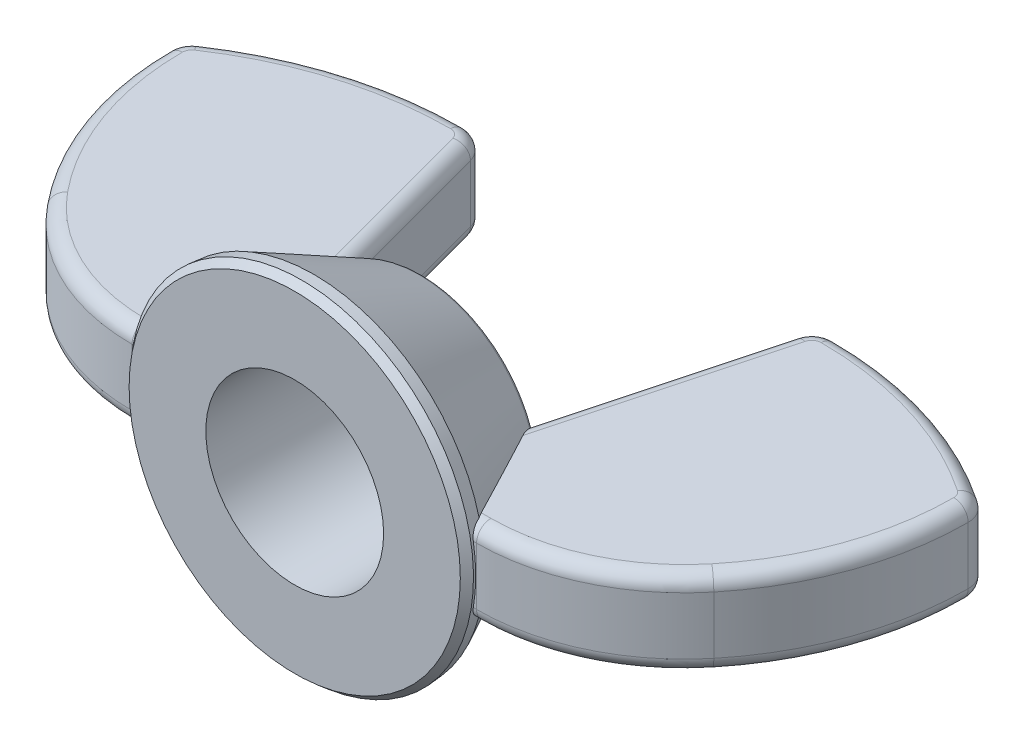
ISO-10303-21;
HEADER;
FILE_DESCRIPTION(('STEP AP214'),'2;1');
FILE_NAME('part.step','',(''),(''),'','','');
FILE_SCHEMA(('AUTOMOTIVE_DESIGN { 1 0 10303 214 1 1 1 1 }'));
ENDSEC;
DATA;
#1=APPLICATION_CONTEXT('core data for automotive mechanical design processes');
#2=APPLICATION_PROTOCOL_DEFINITION('international standard','automotive_design',2000,#1);
#3=PRODUCT_CONTEXT('',#1,'mechanical');
#4=PRODUCT('Part','Part','',(#3));
#5=PRODUCT_RELATED_PRODUCT_CATEGORY('part','',(#4));
#6=PRODUCT_DEFINITION_FORMATION('','',#4);
#7=PRODUCT_DEFINITION_CONTEXT('part definition',#1,'design');
#8=PRODUCT_DEFINITION('design','',#6,#7);
#9=PRODUCT_DEFINITION_SHAPE('','',#8);
#10=(LENGTH_UNIT() NAMED_UNIT(*) SI_UNIT(.MILLI.,.METRE.));
#11=(NAMED_UNIT(*) PLANE_ANGLE_UNIT() SI_UNIT($,.RADIAN.));
#12=(NAMED_UNIT(*) SI_UNIT($,.STERADIAN.) SOLID_ANGLE_UNIT());
#13=UNCERTAINTY_MEASURE_WITH_UNIT(LENGTH_MEASURE(1.E-05),#10,'distance_accuracy_value','');
#14=(GEOMETRIC_REPRESENTATION_CONTEXT(3) GLOBAL_UNCERTAINTY_ASSIGNED_CONTEXT((#13)) GLOBAL_UNIT_ASSIGNED_CONTEXT((#10,
#11,#12)) REPRESENTATION_CONTEXT('',''));
#15=CARTESIAN_POINT('',(0.,0.,0.));
#16=DIRECTION('',(0.,0.,1.));
#17=DIRECTION('',(1.,0.,0.));
#18=AXIS2_PLACEMENT_3D('',#15,#16,#17);
#19=CARTESIAN_POINT('',(-6.1515625,1.537890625,-7.76714773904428));
#20=DIRECTION('',(0.,1.,0.));
#21=DIRECTION('',(0.,0.,1.));
#22=AXIS2_PLACEMENT_3D('',#19,#20,#21);
#23=PLANE('',#22);
#24=DIRECTION('',(-1.,0.,0.));
#25=VECTOR('',#24,1.);
#26=CARTESIAN_POINT('',(-6.1515625,1.537890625,-0.855530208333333));
#27=LINE('',#26,#25);
#28=CARTESIAN_POINT('',(-5.80624980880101,1.537890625,-0.855530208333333));
#29=VERTEX_POINT('',#28);
#30=CARTESIAN_POINT('',(-6.1515625,1.537890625,-0.855530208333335));
#31=VERTEX_POINT('',#30);
#32=EDGE_CURVE('E1315',#29,#31,#27,.T.);
#33=ORIENTED_EDGE('',*,*,#32,.F.);
#34=CARTESIAN_POINT('',(-7.06350110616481,1.537890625,1.58286540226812));
#35=CARTESIAN_POINT('',(-6.82799108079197,1.537890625,1.12394655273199));
#36=CARTESIAN_POINT('',(-6.59211350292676,1.537890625,0.665215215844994));
#37=CARTESIAN_POINT('',(-6.11925817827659,1.537890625,-0.251514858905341));
#38=CARTESIAN_POINT('',(-5.88228076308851,1.537890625,-0.709513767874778));
#39=CARTESIAN_POINT('',(-5.40699790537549,1.537890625,-1.62416181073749));
#40=CARTESIAN_POINT('',(-5.16869428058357,1.537890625,-2.08081188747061));
#41=CARTESIAN_POINT('',(-4.80940790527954,1.537890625,-2.76490461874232));
#42=CARTESIAN_POINT('',(-4.68932419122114,1.537890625,-2.99281935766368));
#43=CARTESIAN_POINT('',(-4.44840014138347,1.537890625,-3.44825441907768));
#44=CARTESIAN_POINT('',(-4.32755979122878,1.537890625,-3.67577473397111));
#45=CARTESIAN_POINT('',(-4.08465666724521,1.537890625,-4.1308036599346));
#46=CARTESIAN_POINT('',(-3.9625917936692,1.537890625,-4.35831115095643));
#47=CARTESIAN_POINT('',(-3.7172225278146,1.537890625,-4.81263823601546));
#48=CARTESIAN_POINT('',(-3.59391821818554,1.537890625,-5.03945787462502));
#49=CARTESIAN_POINT('',(-3.34573645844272,1.537890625,-5.49201600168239));
#50=CARTESIAN_POINT('',(-3.22086024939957,1.537890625,-5.71775516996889));
#51=CARTESIAN_POINT('',(-2.96879155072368,1.537890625,-6.16801294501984));
#52=CARTESIAN_POINT('',(-2.84159851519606,1.537890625,-6.39253124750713));
#53=CARTESIAN_POINT('',(-2.648163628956,1.537890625,-6.72815671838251));
#54=CARTESIAN_POINT('',(-2.58316189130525,1.537890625,-6.83997832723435));
#55=CARTESIAN_POINT('',(-2.45213117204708,1.537890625,-7.06301339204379));
#56=CARTESIAN_POINT('',(-2.38610222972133,1.537890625,-7.17422687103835));
#57=CARTESIAN_POINT('',(-2.25280986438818,1.537890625,-7.39580710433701));
#58=CARTESIAN_POINT('',(-2.18554733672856,1.537890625,-7.5061743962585));
#59=CARTESIAN_POINT('',(-2.04938573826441,1.537890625,-7.72592010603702));
#60=CARTESIAN_POINT('',(-1.98048643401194,1.537890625,-7.83529837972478));
#61=CARTESIAN_POINT('',(-1.84035929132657,1.537890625,-8.05302056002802));
#62=CARTESIAN_POINT('',(-1.76912509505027,1.537890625,-8.16136038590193));
#63=CARTESIAN_POINT('',(-1.62382948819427,1.537890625,-8.37608382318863));
#64=CARTESIAN_POINT('',(-1.54976920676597,1.537890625,-8.48246819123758));
#65=CARTESIAN_POINT('',(-1.43559713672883,1.537890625,-8.6400166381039));
#66=CARTESIAN_POINT('',(-1.39697541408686,1.537890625,-8.69225949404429));
#67=CARTESIAN_POINT('',(-1.31852452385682,1.537890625,-8.79582165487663));
#68=CARTESIAN_POINT('',(-1.27869552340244,1.537890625,-8.84714108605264));
#69=CARTESIAN_POINT('',(-1.19751910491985,1.537890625,-8.94868611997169));
#70=CARTESIAN_POINT('',(-1.15616973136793,1.537890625,-8.99891017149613));
#71=CARTESIAN_POINT('',(-1.0716173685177,1.537890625,-9.09780998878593));
#72=CARTESIAN_POINT('',(-1.02841350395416,1.537890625,-9.14648500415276));
#73=CARTESIAN_POINT('',(-0.984109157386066,1.537890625,-9.19416941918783));
#74=B_SPLINE_CURVE_WITH_KNOTS('',3,(#34,#35,#36,#37,#38,#39,#40,#41,#42,#43,#44,#45,#46,#47,#48,
#49,#50,#51,#52,#53,#54,#55,#56,#57,#58,#59,#60,#61,#62,#63,#64,#65,#66,#67,#68,#69,#70,#71,#72,
#73),.UNSPECIFIED.,.F.,.F.,(4,2,2,2,2,2,2,2,2,2,2,2,2,2,2,2,2,2,2,4),(0.,1.54746473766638,
3.09448983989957,4.63975480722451,5.41259723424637,6.1854543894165,6.96000655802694,
7.73450741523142,8.50843098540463,9.28253933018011,9.67056054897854,10.0585669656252,
10.4463021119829,10.8340928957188,11.2230454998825,11.6118442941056,11.806736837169,
12.001602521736,12.1967282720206,12.3919471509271),.UNSPECIFIED.);
#75=CARTESIAN_POINT('',(-4.1583497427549,1.537890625,-3.99269396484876));
#76=VERTEX_POINT('',#75);
#77=EDGE_CURVE('E430',#29,#76,#74,.T.);
#78=ORIENTED_EDGE('',*,*,#77,.T.);
#79=DIRECTION('',(0.258819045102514,0.,0.96592582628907));
#80=VECTOR('',#79,1.);
#81=CARTESIAN_POINT('',(-4.2780232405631,1.537890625,-4.43932153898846));
#82=LINE('',#81,#80);
#83=CARTESIAN_POINT('',(-6.28623467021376,1.537890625,-11.9340686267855));
#84=VERTEX_POINT('',#83);
#85=EDGE_CURVE('E1309',#84,#76,#82,.T.);
#86=ORIENTED_EDGE('',*,*,#85,.F.);
#87=CARTESIAN_POINT('',(-6.61634317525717,1.537890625,-11.8456163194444));
#88=DIRECTION('',(0.,-1.,0.));
#89=DIRECTION('',(0.,0.,1.));
#90=AXIS2_PLACEMENT_3D('',#87,#88,#89);
#91=CIRCLE('',#90,0.341753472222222);
#92=CARTESIAN_POINT('',(-6.61634317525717,1.537890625,-12.1873697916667));
#93=VERTEX_POINT('',#92);
#94=EDGE_CURVE('E1306',#93,#84,#91,.T.);
#95=ORIENTED_EDGE('',*,*,#94,.F.);
#96=CARTESIAN_POINT('',(-6.61634317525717,1.537890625,0.344762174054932));
#97=DIRECTION('',(0.,-1.,0.));
#98=DIRECTION('',(0.,0.,1.));
#99=AXIS2_PLACEMENT_3D('',#96,#97,#98);
#100=CIRCLE('',#99,12.5321319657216);
#101=CARTESIAN_POINT('',(-13.6242224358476,1.537890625,-10.0448460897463));
#102=VERTEX_POINT('',#101);
#103=EDGE_CURVE('E1303',#102,#93,#100,.T.);
#104=ORIENTED_EDGE('',*,*,#103,.F.);
#105=CARTESIAN_POINT('',(-13.4331163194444,1.537890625,-9.76151962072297));
#106=DIRECTION('',(0.,-1.,0.));
#107=DIRECTION('',(0.,0.,1.));
#108=AXIS2_PLACEMENT_3D('',#105,#106,#107);
#109=CIRCLE('',#108,0.341753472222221);
#110=CARTESIAN_POINT('',(-13.7748697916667,1.537890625,-9.76151962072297));
#111=VERTEX_POINT('',#110);
#112=EDGE_CURVE('E1300',#111,#102,#109,.T.);
#113=ORIENTED_EDGE('',*,*,#112,.F.);
#114=CARTESIAN_POINT('',(-3.71298808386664,1.537890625,-9.76151962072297));
#115=DIRECTION('',(0.,-1.,0.));
#116=DIRECTION('',(0.,0.,1.));
#117=AXIS2_PLACEMENT_3D('',#114,#115,#116);
#118=CIRCLE('',#117,10.0618817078);
#119=CARTESIAN_POINT('',(-11.5017467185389,1.537890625,-3.39153512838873));
#120=VERTEX_POINT('',#119);
#121=EDGE_CURVE('E1297',#120,#111,#118,.T.);
#122=ORIENTED_EDGE('',*,*,#121,.F.);
#123=CARTESIAN_POINT('',(-6.1515625,1.537890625,-7.76714773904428));
#124=DIRECTION('',(0.,-1.,0.));
#125=DIRECTION('',(0.,0.,1.));
#126=AXIS2_PLACEMENT_3D('',#123,#124,#125);
#127=CIRCLE('',#126,6.91161753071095);
#128=EDGE_CURVE('E1312',#31,#120,#127,.T.);
#129=ORIENTED_EDGE('',*,*,#128,.F.);
#130=EDGE_LOOP('',(#33,#78,#86,#95,#104,#113,#122,#129));
#131=FACE_BOUND('',#130,.T.);
#132=ADVANCED_FACE('F38',(#131),#23,.T.);
#133=CARTESIAN_POINT('',(-6.1515625,-1.537890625,-7.76714773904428));
#134=DIRECTION('',(0.,1.,0.));
#135=DIRECTION('',(0.,0.,1.));
#136=AXIS2_PLACEMENT_3D('',#133,#134,#135);
#137=PLANE('',#136);
#138=CARTESIAN_POINT('',(-7.06350110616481,-1.537890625,1.58286540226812));
#139=CARTESIAN_POINT('',(-6.82799108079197,-1.537890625,1.12394655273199));
#140=CARTESIAN_POINT('',(-6.59211350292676,-1.537890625,0.665215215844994));
#141=CARTESIAN_POINT('',(-6.11925817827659,-1.537890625,-0.251514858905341));
#142=CARTESIAN_POINT('',(-5.88228076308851,-1.537890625,-0.709513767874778));
#143=CARTESIAN_POINT('',(-5.40699790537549,-1.537890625,-1.62416181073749));
#144=CARTESIAN_POINT('',(-5.16869428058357,-1.537890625,-2.08081188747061));
#145=CARTESIAN_POINT('',(-4.80940790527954,-1.537890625,-2.76490461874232));
#146=CARTESIAN_POINT('',(-4.68932419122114,-1.537890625,-2.99281935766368));
#147=CARTESIAN_POINT('',(-4.44840014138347,-1.537890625,-3.44825441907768));
#148=CARTESIAN_POINT('',(-4.32755979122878,-1.537890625,-3.67577473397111));
#149=CARTESIAN_POINT('',(-4.08465666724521,-1.537890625,-4.1308036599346));
#150=CARTESIAN_POINT('',(-3.9625917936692,-1.537890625,-4.35831115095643));
#151=CARTESIAN_POINT('',(-3.7172225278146,-1.537890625,-4.81263823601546));
#152=CARTESIAN_POINT('',(-3.59391821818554,-1.537890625,-5.03945787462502));
#153=CARTESIAN_POINT('',(-3.34573645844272,-1.537890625,-5.49201600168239));
#154=CARTESIAN_POINT('',(-3.22086024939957,-1.537890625,-5.71775516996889));
#155=CARTESIAN_POINT('',(-2.96879155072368,-1.537890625,-6.16801294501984));
#156=CARTESIAN_POINT('',(-2.84159851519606,-1.537890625,-6.39253124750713));
#157=CARTESIAN_POINT('',(-2.648163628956,-1.537890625,-6.72815671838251));
#158=CARTESIAN_POINT('',(-2.58316189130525,-1.537890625,-6.83997832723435));
#159=CARTESIAN_POINT('',(-2.45213117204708,-1.537890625,-7.06301339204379));
#160=CARTESIAN_POINT('',(-2.38610222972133,-1.537890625,-7.17422687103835));
#161=CARTESIAN_POINT('',(-2.25280986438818,-1.537890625,-7.39580710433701));
#162=CARTESIAN_POINT('',(-2.18554733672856,-1.537890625,-7.5061743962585));
#163=CARTESIAN_POINT('',(-2.04938573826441,-1.537890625,-7.72592010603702));
#164=CARTESIAN_POINT('',(-1.98048643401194,-1.537890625,-7.83529837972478));
#165=CARTESIAN_POINT('',(-1.84035929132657,-1.537890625,-8.05302056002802));
#166=CARTESIAN_POINT('',(-1.76912509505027,-1.537890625,-8.16136038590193));
#167=CARTESIAN_POINT('',(-1.62382948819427,-1.537890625,-8.37608382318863));
#168=CARTESIAN_POINT('',(-1.54976920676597,-1.537890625,-8.48246819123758));
#169=CARTESIAN_POINT('',(-1.43559713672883,-1.537890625,-8.6400166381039));
#170=CARTESIAN_POINT('',(-1.39697541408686,-1.537890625,-8.69225949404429));
#171=CARTESIAN_POINT('',(-1.31852452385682,-1.537890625,-8.79582165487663));
#172=CARTESIAN_POINT('',(-1.27869552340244,-1.537890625,-8.84714108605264));
#173=CARTESIAN_POINT('',(-1.19751910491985,-1.537890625,-8.94868611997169));
#174=CARTESIAN_POINT('',(-1.15616973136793,-1.537890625,-8.99891017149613));
#175=CARTESIAN_POINT('',(-1.0716173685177,-1.537890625,-9.09780998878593));
#176=CARTESIAN_POINT('',(-1.02841350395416,-1.537890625,-9.14648500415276));
#177=CARTESIAN_POINT('',(-0.984109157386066,-1.537890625,-9.19416941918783));
#178=B_SPLINE_CURVE_WITH_KNOTS('',3,(#138,#139,#140,#141,#142,#143,#144,#145,#146,#147,#148,
#149,#150,#151,#152,#153,#154,#155,#156,#157,#158,#159,#160,#161,#162,#163,#164,#165,#166,#167,
#168,#169,#170,#171,#172,#173,#174,#175,#176,#177),.UNSPECIFIED.,.F.,.F.,(4,2,2,2,2,2,2,2,2,2,2,
2,2,2,2,2,2,2,2,4),(0.,1.54746473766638,3.09448983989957,4.63975480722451,5.41259723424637,
6.1854543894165,6.96000655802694,7.73450741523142,8.50843098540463,9.28253933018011,
9.67056054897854,10.0585669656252,10.4463021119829,10.8340928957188,11.2230454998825,
11.6118442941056,11.806736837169,12.001602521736,12.1967282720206,12.3919471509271),.UNSPECIFIED.);
#179=CARTESIAN_POINT('',(-5.80624980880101,-1.537890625,-0.855530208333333));
#180=VERTEX_POINT('',#179);
#181=CARTESIAN_POINT('',(-4.1583497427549,-1.537890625,-3.99269396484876));
#182=VERTEX_POINT('',#181);
#183=EDGE_CURVE('E503',#180,#182,#178,.T.);
#184=ORIENTED_EDGE('',*,*,#183,.F.);
#185=DIRECTION('',(-1.,0.,0.));
#186=VECTOR('',#185,1.);
#187=CARTESIAN_POINT('',(-6.1515625,-1.537890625,-0.855530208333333));
#188=LINE('',#187,#186);
#189=CARTESIAN_POINT('',(-6.1515625,-1.537890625,-0.855530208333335));
#190=VERTEX_POINT('',#189);
#191=EDGE_CURVE('E1369',#190,#180,#188,.F.);
#192=ORIENTED_EDGE('',*,*,#191,.F.);
#193=CARTESIAN_POINT('',(-6.1515625,-1.537890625,-7.76714773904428));
#194=DIRECTION('',(0.,-1.,0.));
#195=DIRECTION('',(0.,0.,1.));
#196=AXIS2_PLACEMENT_3D('',#193,#194,#195);
#197=CIRCLE('',#196,6.91161753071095);
#198=CARTESIAN_POINT('',(-11.5017467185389,-1.537890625,-3.39153512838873));
#199=VERTEX_POINT('',#198);
#200=EDGE_CURVE('E1366',#199,#190,#197,.F.);
#201=ORIENTED_EDGE('',*,*,#200,.F.);
#202=CARTESIAN_POINT('',(-3.71298808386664,-1.537890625,-9.76151962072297));
#203=DIRECTION('',(0.,-1.,0.));
#204=DIRECTION('',(0.,0.,1.));
#205=AXIS2_PLACEMENT_3D('',#202,#203,#204);
#206=CIRCLE('',#205,10.0618817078);
#207=CARTESIAN_POINT('',(-13.7748697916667,-1.537890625,-9.76151962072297));
#208=VERTEX_POINT('',#207);
#209=EDGE_CURVE('E1352',#208,#199,#206,.F.);
#210=ORIENTED_EDGE('',*,*,#209,.F.);
#211=CARTESIAN_POINT('',(-13.4331163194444,-1.537890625,-9.76151962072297));
#212=DIRECTION('',(0.,-1.,0.));
#213=DIRECTION('',(0.,0.,1.));
#214=AXIS2_PLACEMENT_3D('',#211,#212,#213);
#215=CIRCLE('',#214,0.341753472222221);
#216=CARTESIAN_POINT('',(-13.6242224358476,-1.537890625,-10.0448460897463));
#217=VERTEX_POINT('',#216);
#218=EDGE_CURVE('E1355',#217,#208,#215,.F.);
#219=ORIENTED_EDGE('',*,*,#218,.F.);
#220=CARTESIAN_POINT('',(-6.61634317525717,-1.537890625,0.344762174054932));
#221=DIRECTION('',(0.,-1.,0.));
#222=DIRECTION('',(0.,0.,1.));
#223=AXIS2_PLACEMENT_3D('',#220,#221,#222);
#224=CIRCLE('',#223,12.5321319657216);
#225=CARTESIAN_POINT('',(-6.61634317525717,-1.537890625,-12.1873697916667));
#226=VERTEX_POINT('',#225);
#227=EDGE_CURVE('E1358',#226,#217,#224,.F.);
#228=ORIENTED_EDGE('',*,*,#227,.F.);
#229=CARTESIAN_POINT('',(-6.61634317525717,-1.537890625,-11.8456163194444));
#230=DIRECTION('',(0.,-1.,0.));
#231=DIRECTION('',(0.,0.,1.));
#232=AXIS2_PLACEMENT_3D('',#229,#230,#231);
#233=CIRCLE('',#232,0.341753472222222);
#234=CARTESIAN_POINT('',(-6.28623467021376,-1.537890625,-11.9340686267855));
#235=VERTEX_POINT('',#234);
#236=EDGE_CURVE('E1361',#235,#226,#233,.F.);
#237=ORIENTED_EDGE('',*,*,#236,.F.);
#238=DIRECTION('',(0.258819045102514,0.,0.96592582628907));
#239=VECTOR('',#238,1.);
#240=CARTESIAN_POINT('',(-5.23548312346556,-1.537890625,-8.01261046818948));
#241=LINE('',#240,#239);
#242=EDGE_CURVE('E1364',#182,#235,#241,.F.);
#243=ORIENTED_EDGE('',*,*,#242,.F.);
#244=EDGE_LOOP('',(#184,#192,#201,#210,#219,#228,#237,#243));
#245=FACE_BOUND('',#244,.T.);
#246=ADVANCED_FACE('F414',(#245),#137,.F.);
#247=CARTESIAN_POINT('',(-5.23548312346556,1.02526041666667,-8.01261046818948));
#248=DIRECTION('',(-0.258819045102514,0.,-0.96592582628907));
#249=DIRECTION('',(0.96592582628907,0.,-0.258819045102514));
#250=AXIS2_PLACEMENT_3D('',#247,#248,#249);
#251=CYLINDRICAL_SURFACE('',#250,0.512630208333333);
#252=ORIENTED_EDGE('',*,*,#85,.T.);
#253=CARTESIAN_POINT('',(-4.56046237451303,1.02506041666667,-3.51274785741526));
#254=CARTESIAN_POINT('',(-4.55893320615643,1.04526177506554,-3.5068974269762));
#255=CARTESIAN_POINT('',(-4.55647607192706,1.06581980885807,-3.50241996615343));
#256=CARTESIAN_POINT('',(-4.54972288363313,1.10705466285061,-3.49642725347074));
#257=CARTESIAN_POINT('',(-4.54542735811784,1.12773144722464,-3.49491115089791));
#258=CARTESIAN_POINT('',(-4.5349974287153,1.16868463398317,-3.49505403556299));
#259=CARTESIAN_POINT('',(-4.52885738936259,1.18895960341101,-3.49672283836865));
#260=CARTESIAN_POINT('',(-4.51495256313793,1.22838991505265,-3.50320733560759));
#261=CARTESIAN_POINT('',(-4.5071894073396,1.24754635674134,-3.50801988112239));
#262=CARTESIAN_POINT('',(-4.49058584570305,1.28372089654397,-3.52035538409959));
#263=CARTESIAN_POINT('',(-4.48178315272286,1.30078485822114,-3.52779580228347));
#264=CARTESIAN_POINT('',(-4.46324637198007,1.33311773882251,-3.5450473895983));
#265=CARTESIAN_POINT('',(-4.45351137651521,1.34838487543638,-3.55486088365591));
#266=CARTESIAN_POINT('',(-4.42960756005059,1.3823968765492,-3.58055367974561));
#267=CARTESIAN_POINT('',(-4.41515517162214,1.40027091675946,-3.59732299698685));
#268=CARTESIAN_POINT('',(-4.38570214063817,1.43235890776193,-3.63363588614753));
#269=CARTESIAN_POINT('',(-4.37070060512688,1.44656656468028,-3.65318414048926));
#270=CARTESIAN_POINT('',(-4.3346728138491,1.47649193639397,-3.70236516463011));
#271=CARTESIAN_POINT('',(-4.31360003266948,1.49060168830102,-3.73293807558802));
#272=CARTESIAN_POINT('',(-4.27200585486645,1.51304803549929,-3.7964613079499));
#273=CARTESIAN_POINT('',(-4.25148557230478,1.52137369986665,-3.82941600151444));
#274=CARTESIAN_POINT('',(-4.20274280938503,1.5355407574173,-3.91127361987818));
#275=CARTESIAN_POINT('',(-4.17501670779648,1.53876082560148,-3.96092334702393));
#276=CARTESIAN_POINT('',(-4.12209486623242,1.53662494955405,-4.06137740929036));
#277=CARTESIAN_POINT('',(-4.09690410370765,1.5312524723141,-4.11218378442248));
#278=CARTESIAN_POINT('',(-4.05186383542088,1.51384324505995,-4.20849074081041));
#279=CARTESIAN_POINT('',(-4.03173134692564,1.50255457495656,-4.25399570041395));
#280=CARTESIAN_POINT('',(-4.00350483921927,1.48131801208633,-4.32151083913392));
#281=CARTESIAN_POINT('',(-3.99444877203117,1.47355135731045,-4.34382681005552));
#282=CARTESIAN_POINT('',(-3.9769987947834,1.45658309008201,-4.38817102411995));
#283=CARTESIAN_POINT('',(-3.96860491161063,1.44738141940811,-4.41019925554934));
#284=CARTESIAN_POINT('',(-3.96055789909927,1.43746078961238,-4.43203917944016));
#285=B_SPLINE_CURVE_WITH_KNOTS('',3,(#253,#254,#255,#256,#257,#258,#259,#260,#261,#262,#263,
#264,#265,#266,#267,#268,#269,#270,#271,#272,#273,#274,#275,#276,#277,#278,#279,#280,#281,#282,
#283,#284),.UNSPECIFIED.,.F.,.F.,(4,2,2,2,2,2,2,2,2,2,2,2,2,2,2,4),(0.,0.0632395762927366,
0.126460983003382,0.18987754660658,0.253230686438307,0.314748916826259,0.376327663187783,
0.461213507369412,0.546244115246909,0.664753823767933,0.78348689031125,0.953443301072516,
1.12372712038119,1.2763695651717,1.35224026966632,1.42811405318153),.UNSPECIFIED.);
#286=CARTESIAN_POINT('',(-3.96063158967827,1.43755166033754,-4.4318391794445));
#287=VERTEX_POINT('',#286);
#288=EDGE_CURVE('E438',#76,#287,#285,.T.);
#289=ORIENTED_EDGE('',*,*,#288,.T.);
#290=CARTESIAN_POINT('',(-3.78266048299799,1.064148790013,-4.56554622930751));
#291=CARTESIAN_POINT('',(-3.78548977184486,1.09228650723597,-4.56793044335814));
#292=CARTESIAN_POINT('',(-3.79075176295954,1.12030707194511,-4.57021160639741));
#293=CARTESIAN_POINT('',(-3.80547595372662,1.17568413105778,-4.57242852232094));
#294=CARTESIAN_POINT('',(-3.81499056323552,1.20302770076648,-4.57233417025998));
#295=CARTESIAN_POINT('',(-3.83341601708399,1.24638663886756,-4.56835888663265));
#296=CARTESIAN_POINT('',(-3.84131828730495,1.26294600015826,-4.56584892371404));
#297=CARTESIAN_POINT('',(-3.85813652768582,1.29487008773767,-4.55835725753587));
#298=CARTESIAN_POINT('',(-3.86704685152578,1.31024072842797,-4.55338884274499));
#299=CARTESIAN_POINT('',(-3.88391802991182,1.33712922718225,-4.54154500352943));
#300=CARTESIAN_POINT('',(-3.89180956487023,1.34887375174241,-4.53508910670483));
#301=CARTESIAN_POINT('',(-3.90746973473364,1.37096525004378,-4.51997295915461));
#302=CARTESIAN_POINT('',(-3.91523834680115,1.38131196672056,-4.51131230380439));
#303=CARTESIAN_POINT('',(-3.93004520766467,1.40031157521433,-4.4918883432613));
#304=CARTESIAN_POINT('',(-3.93708685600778,1.40897253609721,-4.48113557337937));
#305=CARTESIAN_POINT('',(-3.94996257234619,1.42461543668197,-4.45773329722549));
#306=CARTESIAN_POINT('',(-3.95578967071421,1.43158772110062,-4.44507352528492));
#307=CARTESIAN_POINT('',(-3.96070520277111,1.43764241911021,-4.43163917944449));
#308=B_SPLINE_CURVE_WITH_KNOTS('',3,(#290,#291,#292,#293,#294,#295,#296,#297,#298,#299,#300,
#301,#302,#303,#304,#305,#306,#307),.UNSPECIFIED.,.F.,.F.,(4,2,2,2,2,2,2,2,4),(0.,
0.0852742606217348,0.171629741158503,0.226996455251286,0.282067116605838,0.328528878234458,
0.374999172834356,0.421241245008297,0.467741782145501),.UNSPECIFIED.);
#309=CARTESIAN_POINT('',(-3.80768055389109,1.18019646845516,-4.572));
#310=VERTEX_POINT('',#309);
#311=EDGE_CURVE('E304',#310,#287,#308,.T.);
#312=ORIENTED_EDGE('',*,*,#311,.F.);
#313=CARTESIAN_POINT('',(-4.31357432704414,1.02526041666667,-4.572));
#314=DIRECTION('',(0.,0.,-1.));
#315=DIRECTION('',(-1.,0.,0.));
#316=AXIS2_PLACEMENT_3D('',#313,#314,#315);
#317=ELLIPSE('',#316,0.530713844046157,0.512630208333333);
#318=CARTESIAN_POINT('',(-3.78286048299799,1.02526041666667,-4.572));
#319=VERTEX_POINT('',#318);
#320=EDGE_CURVE('E1273',#319,#310,#317,.F.);
#321=ORIENTED_EDGE('',*,*,#320,.F.);
#322=DIRECTION('',(0.258819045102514,0.,0.96592582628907));
#323=VECTOR('',#322,1.);
#324=CARTESIAN_POINT('',(-5.79107191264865,1.02526041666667,-12.066747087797));
#325=LINE('',#324,#323);
#326=CARTESIAN_POINT('',(-5.79107191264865,1.02526041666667,-12.066747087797));
#327=VERTEX_POINT('',#326);
#328=EDGE_CURVE('E1331',#319,#327,#325,.F.);
#329=ORIENTED_EDGE('',*,*,#328,.T.);
#330=CARTESIAN_POINT('',(-6.28623467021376,1.02526041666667,-11.9340686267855));
#331=DIRECTION('',(0.258819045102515,0.,0.96592582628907));
#332=DIRECTION('',(0.96592582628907,0.,-0.258819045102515));
#333=AXIS2_PLACEMENT_3D('',#330,#331,#332);
#334=CIRCLE('',#333,0.512630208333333);
#335=EDGE_CURVE('E1279',#327,#84,#334,.T.);
#336=ORIENTED_EDGE('',*,*,#335,.T.);
#337=EDGE_LOOP('',(#252,#289,#312,#321,#329,#336));
#338=FACE_BOUND('',#337,.T.);
#339=ADVANCED_FACE('F384',(#338),#251,.T.);
#340=CARTESIAN_POINT('',(-4.2780232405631,-1.02526041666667,-4.43932153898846));
#341=DIRECTION('',(0.258819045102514,0.,0.96592582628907));
#342=DIRECTION('',(-0.96592582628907,0.,0.258819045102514));
#343=AXIS2_PLACEMENT_3D('',#340,#341,#342);
#344=CYLINDRICAL_SURFACE('',#343,0.512630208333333);
#345=CARTESIAN_POINT('',(-3.96070520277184,-1.43764241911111,-4.43163917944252));
#346=CARTESIAN_POINT('',(-3.95608193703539,-1.43194581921,-4.44426588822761));
#347=CARTESIAN_POINT('',(-3.95065441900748,-1.4254425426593,-4.45621434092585));
#348=CARTESIAN_POINT('',(-3.93868771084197,-1.41092766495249,-4.47843674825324));
#349=CARTESIAN_POINT('',(-3.93215409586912,-1.40292360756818,-4.48871861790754));
#350=CARTESIAN_POINT('',(-3.91841873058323,-1.38545645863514,-4.50741710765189));
#351=CARTESIAN_POINT('',(-3.91121709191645,-1.37599361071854,-4.51583403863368));
#352=CARTESIAN_POINT('',(-3.89661409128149,-1.35579168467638,-4.53073851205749));
#353=CARTESIAN_POINT('',(-3.88921262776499,-1.34505194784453,-4.53722505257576));
#354=CARTESIAN_POINT('',(-3.8741916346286,-1.32187107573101,-4.54866404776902));
#355=CARTESIAN_POINT('',(-3.86658465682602,-1.30936717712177,-4.55350463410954));
#356=CARTESIAN_POINT('',(-3.85196712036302,-1.28346498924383,-4.56133689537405));
#357=CARTESIAN_POINT('',(-3.84495714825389,-1.27006584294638,-4.56432676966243));
#358=CARTESIAN_POINT('',(-3.82781560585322,-1.23431212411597,-4.57010167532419));
#359=CARTESIAN_POINT('',(-3.81835700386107,-1.21143813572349,-4.57167146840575));
#360=CARTESIAN_POINT('',(-3.80229097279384,-1.16469471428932,-4.57223551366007));
#361=CARTESIAN_POINT('',(-3.79568797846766,-1.14082379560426,-4.57122577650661));
#362=CARTESIAN_POINT('',(-3.7871636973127,-1.09928436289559,-4.56848429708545));
#363=CARTESIAN_POINT('',(-3.78444829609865,-1.08175735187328,-4.56703507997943));
#364=CARTESIAN_POINT('',(-3.78266048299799,-1.064148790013,-4.56554622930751));
#365=B_SPLINE_CURVE_WITH_KNOTS('',3,(#345,#346,#347,#348,#349,#350,#351,#352,#353,#354,#355,
#356,#357,#358,#359,#360,#361,#362,#363,#364),.UNSPECIFIED.,.F.,.F.,(4,2,2,2,2,2,2,2,2,4),(0.,
0.0437299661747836,0.0872457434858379,0.130754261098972,0.174285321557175,0.220361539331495,
0.266482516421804,0.340469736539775,0.41457144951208,0.467855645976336),.UNSPECIFIED.);
#366=CARTESIAN_POINT('',(-3.96063158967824,-1.43755166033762,-4.4318391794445));
#367=VERTEX_POINT('',#366);
#368=CARTESIAN_POINT('',(-3.80768055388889,-1.18019646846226,-4.572));
#369=VERTEX_POINT('',#368);
#370=EDGE_CURVE('E47',#367,#369,#365,.T.);
#371=ORIENTED_EDGE('',*,*,#370,.F.);
#372=CARTESIAN_POINT('',(-3.96055789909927,-1.43746078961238,-4.43203917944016));
#373=CARTESIAN_POINT('',(-3.97123517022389,-1.45061455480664,-4.4030630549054));
#374=CARTESIAN_POINT('',(-3.98252362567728,-1.46251731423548,-4.37375073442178));
#375=CARTESIAN_POINT('',(-4.0062548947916,-1.48380250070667,-4.31465384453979));
#376=CARTESIAN_POINT('',(-4.01869853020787,-1.49318311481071,-4.28486895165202));
#377=CARTESIAN_POINT('',(-4.04477866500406,-1.50946293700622,-4.22478808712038));
#378=CARTESIAN_POINT('',(-4.05842528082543,-1.51633798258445,-4.19448994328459));
#379=CARTESIAN_POINT('',(-4.08673868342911,-1.5273631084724,-4.13389187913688));
#380=CARTESIAN_POINT('',(-4.10140507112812,-1.53151424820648,-4.10359196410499));
#381=CARTESIAN_POINT('',(-4.13930984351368,-1.53827756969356,-4.02803888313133));
#382=CARTESIAN_POINT('',(-4.16315752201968,-1.53907307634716,-3.98290950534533));
#383=CARTESIAN_POINT('',(-4.21266424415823,-1.5331689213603,-3.89426127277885));
#384=CARTESIAN_POINT('',(-4.23831682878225,-1.52649482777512,-3.8507374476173));
#385=CARTESIAN_POINT('',(-4.28258827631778,-1.50777610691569,-3.78003040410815));
#386=CARTESIAN_POINT('',(-4.30087633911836,-1.49808653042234,-3.7520198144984));
#387=CARTESIAN_POINT('',(-4.33768263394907,-1.47395922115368,-3.69825711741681));
#388=CARTESIAN_POINT('',(-4.3562005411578,-1.45952758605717,-3.67250216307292));
#389=CARTESIAN_POINT('',(-4.38846731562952,-1.42944811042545,-3.63016775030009));
#390=CARTESIAN_POINT('',(-4.40229943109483,-1.41491288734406,-3.61286556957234));
#391=CARTESIAN_POINT('',(-4.42931269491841,-1.3826136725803,-3.58095451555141));
#392=CARTESIAN_POINT('',(-4.44249456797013,-1.36485338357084,-3.56634259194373));
#393=CARTESIAN_POINT('',(-4.46547313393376,-1.32951212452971,-3.54284764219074));
#394=CARTESIAN_POINT('',(-4.47546206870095,-1.31242592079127,-3.5334115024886));
#395=CARTESIAN_POINT('',(-4.49421814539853,-1.27634173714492,-3.51742517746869));
#396=CARTESIAN_POINT('',(-4.50298646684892,-1.25734563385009,-3.51087219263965));
#397=CARTESIAN_POINT('',(-4.51896698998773,-1.21781381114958,-3.50099548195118));
#398=CARTESIAN_POINT('',(-4.52617291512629,-1.1972723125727,-3.49768459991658));
#399=CARTESIAN_POINT('',(-4.53870368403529,-1.15534425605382,-3.49450060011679));
#400=CARTESIAN_POINT('',(-4.54402728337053,-1.13395714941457,-3.49462975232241));
#401=CARTESIAN_POINT('',(-4.55129848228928,-1.09784663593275,-3.49765554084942));
#402=CARTESIAN_POINT('',(-4.55378128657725,-1.0831459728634,-3.49966774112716));
#403=CARTESIAN_POINT('',(-4.55781275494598,-1.05392946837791,-3.50514651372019));
#404=CARTESIAN_POINT('',(-4.5593639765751,-1.0394132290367,-3.50860905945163));
#405=CARTESIAN_POINT('',(-4.56046237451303,-1.02506041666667,-3.51274785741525));
#406=B_SPLINE_CURVE_WITH_KNOTS('',3,(#372,#373,#374,#375,#376,#377,#378,#379,#380,#381,#382,
#383,#384,#385,#386,#387,#388,#389,#390,#391,#392,#393,#394,#395,#396,#397,#398,#399,#400,#401,
#402,#403,#404,#405),.UNSPECIFIED.,.F.,.F.,(4,2,2,2,2,2,2,2,2,2,2,2,2,2,2,2,4),(0.,
0.100657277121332,0.201386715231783,0.303063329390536,0.404700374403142,0.55732384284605,
0.709426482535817,0.813599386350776,0.917638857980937,0.996843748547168,1.07595827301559,
1.14146258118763,1.2069031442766,1.27260191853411,1.33834404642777,1.3833805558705,
1.42829285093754),.UNSPECIFIED.);
#407=EDGE_CURVE('E509',#367,#182,#406,.T.);
#408=ORIENTED_EDGE('',*,*,#407,.T.);
#409=ORIENTED_EDGE('',*,*,#242,.T.);
#410=CARTESIAN_POINT('',(-6.28623467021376,-1.02526041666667,-11.9340686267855));
#411=DIRECTION('',(0.258819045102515,0.,0.96592582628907));
#412=DIRECTION('',(0.96592582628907,0.,-0.258819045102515));
#413=AXIS2_PLACEMENT_3D('',#410,#411,#412);
#414=CIRCLE('',#413,0.512630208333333);
#415=CARTESIAN_POINT('',(-5.79107191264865,-1.02526041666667,-12.066747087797));
#416=VERTEX_POINT('',#415);
#417=EDGE_CURVE('E1381',#235,#416,#414,.T.);
#418=ORIENTED_EDGE('',*,*,#417,.T.);
#419=DIRECTION('',(0.258819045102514,0.,0.96592582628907));
#420=VECTOR('',#419,1.);
#421=CARTESIAN_POINT('',(-3.78286048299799,-1.02526041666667,-4.572));
#422=LINE('',#421,#420);
#423=CARTESIAN_POINT('',(-3.78286048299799,-1.02526041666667,-4.572));
#424=VERTEX_POINT('',#423);
#425=EDGE_CURVE('E1328',#416,#424,#422,.T.);
#426=ORIENTED_EDGE('',*,*,#425,.T.);
#427=CARTESIAN_POINT('',(-4.31357432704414,-1.02526041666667,-4.572));
#428=DIRECTION('',(0.,0.,-1.));
#429=DIRECTION('',(1.,0.,0.));
#430=AXIS2_PLACEMENT_3D('',#427,#428,#429);
#431=ELLIPSE('',#430,0.530713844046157,0.512630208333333);
#432=EDGE_CURVE('E11',#369,#424,#431,.F.);
#433=ORIENTED_EDGE('',*,*,#432,.F.);
#434=EDGE_LOOP('',(#371,#408,#409,#418,#426,#433));
#435=FACE_BOUND('',#434,.T.);
#436=ADVANCED_FACE('F40',(#435),#344,.T.);
#437=CARTESIAN_POINT('',(-3.78286048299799,1.537890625,-0.3429));
#438=DIRECTION('',(0.,0.,-1.));
#439=DIRECTION('',(1.,0.,0.));
#440=AXIS2_PLACEMENT_3D('',#437,#438,#439);
#441=PLANE('',#440);
#442=DIRECTION('',(-1.,0.,0.));
#443=VECTOR('',#442,1.);
#444=CARTESIAN_POINT('',(-3.78286048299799,-1.02526041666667,-0.3429));
#445=LINE('',#444,#443);
#446=CARTESIAN_POINT('',(-6.03509487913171,-1.02526041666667,-0.3429));
#447=VERTEX_POINT('',#446);
#448=CARTESIAN_POINT('',(-6.1515625,-1.02526041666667,-0.3429));
#449=VERTEX_POINT('',#448);
#450=EDGE_CURVE('E1317',#447,#449,#445,.T.);
#451=ORIENTED_EDGE('',*,*,#450,.F.);
#452=CARTESIAN_POINT('',(0.,0.,-0.342900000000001));
#453=DIRECTION('',(0.,0.,-1.));
#454=DIRECTION('',(-1.,0.,0.));
#455=AXIS2_PLACEMENT_3D('',#452,#453,#454);
#456=CIRCLE('',#455,6.12156263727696);
#457=CARTESIAN_POINT('',(-6.03509487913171,1.02526041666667,-0.3429));
#458=VERTEX_POINT('',#457);
#459=EDGE_CURVE('E1267',#447,#458,#456,.T.);
#460=ORIENTED_EDGE('',*,*,#459,.T.);
#461=DIRECTION('',(-1.,0.,0.));
#462=VECTOR('',#461,1.);
#463=CARTESIAN_POINT('',(-3.78286048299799,1.02526041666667,-0.3429));
#464=LINE('',#463,#462);
#465=CARTESIAN_POINT('',(-6.1515625,1.02526041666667,-0.3429));
#466=VERTEX_POINT('',#465);
#467=EDGE_CURVE('E1319',#466,#458,#464,.F.);
#468=ORIENTED_EDGE('',*,*,#467,.F.);
#469=DIRECTION('',(0.,-1.,0.));
#470=VECTOR('',#469,1.);
#471=CARTESIAN_POINT('',(-6.1515625,1.537890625,-0.3429));
#472=LINE('',#471,#470);
#473=EDGE_CURVE('E1294',#466,#449,#472,.T.);
#474=ORIENTED_EDGE('',*,*,#473,.T.);
#475=EDGE_LOOP('',(#451,#460,#468,#474));
#476=FACE_BOUND('',#475,.T.);
#477=ADVANCED_FACE('F1026',(#476),#441,.F.);
#478=CARTESIAN_POINT('',(-6.1515625,1.537890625,-7.76714773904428));
#479=DIRECTION('',(0.,-1.,0.));
#480=DIRECTION('',(0.,0.,-1.));
#481=AXIS2_PLACEMENT_3D('',#478,#479,#480);
#482=CYLINDRICAL_SURFACE('',#481,7.42424773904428);
#483=DIRECTION('',(0.,-1.,0.));
#484=VECTOR('',#483,1.);
#485=CARTESIAN_POINT('',(-11.8985664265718,1.537890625,-3.0669987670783));
#486=LINE('',#485,#484);
#487=CARTESIAN_POINT('',(-11.8985664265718,1.02526041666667,-3.0669987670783));
#488=VERTEX_POINT('',#487);
#489=CARTESIAN_POINT('',(-11.8985664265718,-1.02526041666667,-3.0669987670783));
#490=VERTEX_POINT('',#489);
#491=EDGE_CURVE('E1291',#488,#490,#486,.T.);
#492=ORIENTED_EDGE('',*,*,#491,.T.);
#493=CARTESIAN_POINT('',(-6.1515625,-1.02526041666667,-7.76714773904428));
#494=DIRECTION('',(0.,-1.,0.));
#495=DIRECTION('',(0.,0.,1.));
#496=AXIS2_PLACEMENT_3D('',#493,#494,#495);
#497=CIRCLE('',#496,7.42424773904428);
#498=EDGE_CURVE('E1322',#449,#490,#497,.T.);
#499=ORIENTED_EDGE('',*,*,#498,.F.);
#500=ORIENTED_EDGE('',*,*,#473,.F.);
#501=CARTESIAN_POINT('',(-6.1515625,1.02526041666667,-7.76714773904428));
#502=DIRECTION('',(0.,-1.,0.));
#503=DIRECTION('',(0.,0.,1.));
#504=AXIS2_PLACEMENT_3D('',#501,#502,#503);
#505=CIRCLE('',#504,7.42424773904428);
#506=EDGE_CURVE('E1325',#488,#466,#505,.F.);
#507=ORIENTED_EDGE('',*,*,#506,.F.);
#508=EDGE_LOOP('',(#492,#499,#500,#507));
#509=FACE_BOUND('',#508,.T.);
#510=ADVANCED_FACE('F1047',(#509),#482,.T.);
#511=CARTESIAN_POINT('',(-3.71298808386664,1.537890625,-9.76151962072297));
#512=DIRECTION('',(0.,-1.,0.));
#513=DIRECTION('',(0.,0.,-1.));
#514=AXIS2_PLACEMENT_3D('',#511,#512,#513);
#515=CYLINDRICAL_SURFACE('',#514,10.5745119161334);
#516=DIRECTION('',(0.,-1.,0.));
#517=VECTOR('',#516,1.);
#518=CARTESIAN_POINT('',(-14.2875,1.537890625,-9.76151962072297));
#519=LINE('',#518,#517);
#520=CARTESIAN_POINT('',(-14.2875,1.02526041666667,-9.76151962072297));
#521=VERTEX_POINT('',#520);
#522=CARTESIAN_POINT('',(-14.2875,-1.02526041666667,-9.76151962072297));
#523=VERTEX_POINT('',#522);
#524=EDGE_CURVE('E1288',#521,#523,#519,.T.);
#525=ORIENTED_EDGE('',*,*,#524,.T.);
#526=CARTESIAN_POINT('',(-3.71298808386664,-1.02526041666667,-9.76151962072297));
#527=DIRECTION('',(0.,-1.,0.));
#528=DIRECTION('',(0.,0.,1.));
#529=AXIS2_PLACEMENT_3D('',#526,#527,#528);
#530=CIRCLE('',#529,10.5745119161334);
#531=EDGE_CURVE('E1371',#490,#523,#530,.T.);
#532=ORIENTED_EDGE('',*,*,#531,.F.);
#533=ORIENTED_EDGE('',*,*,#491,.F.);
#534=CARTESIAN_POINT('',(-3.71298808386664,1.02526041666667,-9.76151962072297));
#535=DIRECTION('',(0.,-1.,0.));
#536=DIRECTION('',(0.,0.,1.));
#537=AXIS2_PLACEMENT_3D('',#534,#535,#536);
#538=CIRCLE('',#537,10.5745119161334);
#539=EDGE_CURVE('E1374',#521,#488,#538,.F.);
#540=ORIENTED_EDGE('',*,*,#539,.F.);
#541=EDGE_LOOP('',(#525,#532,#533,#540));
#542=FACE_BOUND('',#541,.T.);
#543=ADVANCED_FACE('F1053',(#542),#515,.T.);
#544=CARTESIAN_POINT('',(-13.4331163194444,1.537890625,-9.76151962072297));
#545=DIRECTION('',(0.,-1.,0.));
#546=DIRECTION('',(0.,0.,-1.));
#547=AXIS2_PLACEMENT_3D('',#544,#545,#546);
#548=CYLINDRICAL_SURFACE('',#547,0.854383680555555);
#549=DIRECTION('',(0.,-1.,0.));
#550=VECTOR('',#549,1.);
#551=CARTESIAN_POINT('',(-13.9108816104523,1.537890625,-10.4698357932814));
#552=LINE('',#551,#550);
#553=CARTESIAN_POINT('',(-13.9108816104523,1.02526041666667,-10.4698357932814));
#554=VERTEX_POINT('',#553);
#555=CARTESIAN_POINT('',(-13.9108816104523,-1.02526041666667,-10.4698357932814));
#556=VERTEX_POINT('',#555);
#557=EDGE_CURVE('E1285',#554,#556,#552,.T.);
#558=ORIENTED_EDGE('',*,*,#557,.T.);
#559=CARTESIAN_POINT('',(-13.4331163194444,-1.02526041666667,-9.76151962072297));
#560=DIRECTION('',(0.,-1.,0.));
#561=DIRECTION('',(0.,0.,1.));
#562=AXIS2_PLACEMENT_3D('',#559,#560,#561);
#563=CIRCLE('',#562,0.854383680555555);
#564=EDGE_CURVE('E1346',#523,#556,#563,.T.);
#565=ORIENTED_EDGE('',*,*,#564,.F.);
#566=ORIENTED_EDGE('',*,*,#524,.F.);
#567=CARTESIAN_POINT('',(-13.4331163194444,1.02526041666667,-9.76151962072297));
#568=DIRECTION('',(0.,-1.,0.));
#569=DIRECTION('',(0.,0.,1.));
#570=AXIS2_PLACEMENT_3D('',#567,#568,#569);
#571=CIRCLE('',#570,0.854383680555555);
#572=EDGE_CURVE('E1349',#554,#521,#571,.F.);
#573=ORIENTED_EDGE('',*,*,#572,.F.);
#574=EDGE_LOOP('',(#558,#565,#566,#573));
#575=FACE_BOUND('',#574,.T.);
#576=ADVANCED_FACE('F1065',(#575),#548,.T.);
#577=CARTESIAN_POINT('',(-6.61634317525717,1.537890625,0.344762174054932));
#578=DIRECTION('',(0.,-1.,0.));
#579=DIRECTION('',(0.,0.,-1.));
#580=AXIS2_PLACEMENT_3D('',#577,#578,#579);
#581=CYLINDRICAL_SURFACE('',#580,13.0447621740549);
#582=DIRECTION('',(0.,-1.,0.));
#583=VECTOR('',#582,1.);
#584=CARTESIAN_POINT('',(-6.61634317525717,1.537890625,-12.7));
#585=LINE('',#584,#583);
#586=CARTESIAN_POINT('',(-6.61634317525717,1.02526041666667,-12.7));
#587=VERTEX_POINT('',#586);
#588=CARTESIAN_POINT('',(-6.61634317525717,-1.02526041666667,-12.7));
#589=VERTEX_POINT('',#588);
#590=EDGE_CURVE('E1282',#587,#589,#585,.T.);
#591=ORIENTED_EDGE('',*,*,#590,.T.);
#592=CARTESIAN_POINT('',(-6.61634317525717,-1.02526041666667,0.344762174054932));
#593=DIRECTION('',(0.,-1.,0.));
#594=DIRECTION('',(0.,0.,1.));
#595=AXIS2_PLACEMENT_3D('',#592,#593,#594);
#596=CIRCLE('',#595,13.0447621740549);
#597=EDGE_CURVE('E1340',#556,#589,#596,.T.);
#598=ORIENTED_EDGE('',*,*,#597,.F.);
#599=ORIENTED_EDGE('',*,*,#557,.F.);
#600=CARTESIAN_POINT('',(-6.61634317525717,1.02526041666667,0.344762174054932));
#601=DIRECTION('',(0.,-1.,0.));
#602=DIRECTION('',(0.,0.,1.));
#603=AXIS2_PLACEMENT_3D('',#600,#601,#602);
#604=CIRCLE('',#603,13.0447621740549);
#605=EDGE_CURVE('E1343',#587,#554,#604,.F.);
#606=ORIENTED_EDGE('',*,*,#605,.F.);
#607=EDGE_LOOP('',(#591,#598,#599,#606));
#608=FACE_BOUND('',#607,.T.);
#609=ADVANCED_FACE('F1076',(#608),#581,.T.);
#610=CARTESIAN_POINT('',(-6.61634317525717,1.537890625,-11.8456163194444));
#611=DIRECTION('',(0.,-1.,0.));
#612=DIRECTION('',(0.,0.,-1.));
#613=AXIS2_PLACEMENT_3D('',#610,#611,#612);
#614=CYLINDRICAL_SURFACE('',#613,0.854383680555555);
#615=DIRECTION('',(0.,-1.,0.));
#616=VECTOR('',#615,1.);
#617=CARTESIAN_POINT('',(-5.79107191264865,1.537890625,-12.066747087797));
#618=LINE('',#617,#616);
#619=EDGE_CURVE('E1278',#327,#416,#618,.T.);
#620=ORIENTED_EDGE('',*,*,#619,.T.);
#621=CARTESIAN_POINT('',(-6.61634317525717,-1.02526041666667,-11.8456163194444));
#622=DIRECTION('',(0.,-1.,0.));
#623=DIRECTION('',(0.,0.,1.));
#624=AXIS2_PLACEMENT_3D('',#621,#622,#623);
#625=CIRCLE('',#624,0.854383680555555);
#626=EDGE_CURVE('E1334',#589,#416,#625,.T.);
#627=ORIENTED_EDGE('',*,*,#626,.F.);
#628=ORIENTED_EDGE('',*,*,#590,.F.);
#629=CARTESIAN_POINT('',(-6.61634317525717,1.02526041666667,-11.8456163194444));
#630=DIRECTION('',(0.,-1.,0.));
#631=DIRECTION('',(0.,0.,1.));
#632=AXIS2_PLACEMENT_3D('',#629,#630,#631);
#633=CIRCLE('',#632,0.854383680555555);
#634=EDGE_CURVE('E1337',#327,#587,#633,.F.);
#635=ORIENTED_EDGE('',*,*,#634,.F.);
#636=EDGE_LOOP('',(#620,#627,#628,#635));
#637=FACE_BOUND('',#636,.T.);
#638=ADVANCED_FACE('F1037',(#637),#614,.T.);
#639=CARTESIAN_POINT('',(-3.78286048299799,1.537890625,-4.572));
#640=DIRECTION('',(-0.96592582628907,0.,0.258819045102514));
#641=DIRECTION('',(-0.258819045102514,0.,-0.96592582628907));
#642=AXIS2_PLACEMENT_3D('',#639,#640,#641);
#643=PLANE('',#642);
#644=DIRECTION('',(0.,-1.,0.));
#645=VECTOR('',#644,1.);
#646=CARTESIAN_POINT('',(-3.78286048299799,1.537890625,-4.572));
#647=LINE('',#646,#645);
#648=EDGE_CURVE('E1275',#319,#424,#647,.T.);
#649=ORIENTED_EDGE('',*,*,#648,.T.);
#650=ORIENTED_EDGE('',*,*,#425,.F.);
#651=ORIENTED_EDGE('',*,*,#619,.F.);
#652=ORIENTED_EDGE('',*,*,#328,.F.);
#653=EDGE_LOOP('',(#649,#650,#651,#652));
#654=FACE_BOUND('',#653,.T.);
#655=ADVANCED_FACE('F1030',(#654),#643,.F.);
#656=CARTESIAN_POINT('',(-6.61634317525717,1.02526041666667,-11.8456163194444));
#657=DIRECTION('',(0.,1.,0.));
#658=DIRECTION('',(0.,0.,1.));
#659=AXIS2_PLACEMENT_3D('',#656,#657,#658);
#660=DEGENERATE_TOROIDAL_SURFACE('',#659,0.341753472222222,0.512630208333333,.T.);
#661=ORIENTED_EDGE('',*,*,#335,.F.);
#662=ORIENTED_EDGE('',*,*,#634,.T.);
#663=CARTESIAN_POINT('',(-6.61634317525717,1.02526041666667,-12.1873697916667));
#664=DIRECTION('',(1.,0.,0.));
#665=DIRECTION('',(0.,0.,-1.));
#666=AXIS2_PLACEMENT_3D('',#663,#664,#665);
#667=CIRCLE('',#666,0.512630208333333);
#668=EDGE_CURVE('E1387',#587,#93,#667,.T.);
#669=ORIENTED_EDGE('',*,*,#668,.T.);
#670=ORIENTED_EDGE('',*,*,#94,.T.);
#671=EDGE_LOOP('',(#661,#662,#669,#670));
#672=FACE_BOUND('',#671,.T.);
#673=ADVANCED_FACE('F1036',(#672),#660,.T.);
#674=CARTESIAN_POINT('',(-6.61634317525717,1.02526041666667,0.344762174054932));
#675=DIRECTION('',(0.,1.,0.));
#676=DIRECTION('',(0.,0.,1.));
#677=AXIS2_PLACEMENT_3D('',#674,#675,#676);
#678=TOROIDAL_SURFACE('',#677,12.5321319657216,0.512630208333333);
#679=ORIENTED_EDGE('',*,*,#668,.F.);
#680=ORIENTED_EDGE('',*,*,#605,.T.);
#681=CARTESIAN_POINT('',(-13.6242224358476,1.02526041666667,-10.0448460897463));
#682=DIRECTION('',(0.829037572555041,0.,-0.559192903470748));
#683=DIRECTION('',(-0.559192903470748,0.,-0.829037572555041));
#684=AXIS2_PLACEMENT_3D('',#681,#682,#683);
#685=CIRCLE('',#684,0.512630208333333);
#686=EDGE_CURVE('E1385',#554,#102,#685,.T.);
#687=ORIENTED_EDGE('',*,*,#686,.T.);
#688=ORIENTED_EDGE('',*,*,#103,.T.);
#689=EDGE_LOOP('',(#679,#680,#687,#688));
#690=FACE_BOUND('',#689,.T.);
#691=ADVANCED_FACE('F1144',(#690),#678,.T.);
#692=CARTESIAN_POINT('',(-13.4331163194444,1.02526041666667,-9.76151962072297));
#693=DIRECTION('',(0.,1.,0.));
#694=DIRECTION('',(0.,0.,1.));
#695=AXIS2_PLACEMENT_3D('',#692,#693,#694);
#696=DEGENERATE_TOROIDAL_SURFACE('',#695,0.341753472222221,0.512630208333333,.T.);
#697=ORIENTED_EDGE('',*,*,#686,.F.);
#698=ORIENTED_EDGE('',*,*,#572,.T.);
#699=CARTESIAN_POINT('',(-13.7748697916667,1.02526041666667,-9.76151962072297));
#700=DIRECTION('',(0.,0.,-1.));
#701=DIRECTION('',(-1.,0.,0.));
#702=AXIS2_PLACEMENT_3D('',#699,#700,#701);
#703=CIRCLE('',#702,0.512630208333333);
#704=EDGE_CURVE('E1383',#521,#111,#703,.T.);
#705=ORIENTED_EDGE('',*,*,#704,.T.);
#706=ORIENTED_EDGE('',*,*,#112,.T.);
#707=EDGE_LOOP('',(#697,#698,#705,#706));
#708=FACE_BOUND('',#707,.T.);
#709=ADVANCED_FACE('F1138',(#708),#696,.T.);
#710=CARTESIAN_POINT('',(-3.71298808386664,1.02526041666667,-9.76151962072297));
#711=DIRECTION('',(0.,1.,0.));
#712=DIRECTION('',(0.,0.,1.));
#713=AXIS2_PLACEMENT_3D('',#710,#711,#712);
#714=TOROIDAL_SURFACE('',#713,10.0618817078,0.512630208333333);
#715=ORIENTED_EDGE('',*,*,#704,.F.);
#716=ORIENTED_EDGE('',*,*,#539,.T.);
#717=CARTESIAN_POINT('',(-11.5017467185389,1.02526041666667,-3.39153512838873));
#718=DIRECTION('',(-0.633080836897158,0.,-0.774085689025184));
#719=DIRECTION('',(-0.774085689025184,0.,0.633080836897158));
#720=AXIS2_PLACEMENT_3D('',#717,#718,#719);
#721=CIRCLE('',#720,0.512630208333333);
#722=EDGE_CURVE('E1380',#488,#120,#721,.T.);
#723=ORIENTED_EDGE('',*,*,#722,.T.);
#724=ORIENTED_EDGE('',*,*,#121,.T.);
#725=EDGE_LOOP('',(#715,#716,#723,#724));
#726=FACE_BOUND('',#725,.T.);
#727=ADVANCED_FACE('F1143',(#726),#714,.T.);
#728=CARTESIAN_POINT('',(-6.1515625,1.02526041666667,-7.76714773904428));
#729=DIRECTION('',(0.,1.,0.));
#730=DIRECTION('',(0.,0.,1.));
#731=AXIS2_PLACEMENT_3D('',#728,#729,#730);
#732=TOROIDAL_SURFACE('',#731,6.91161753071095,0.512630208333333);
#733=ORIENTED_EDGE('',*,*,#722,.F.);
#734=ORIENTED_EDGE('',*,*,#506,.T.);
#735=CARTESIAN_POINT('',(-6.1515625,1.02526041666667,-0.855530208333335));
#736=DIRECTION('',(-1.,0.,0.));
#737=DIRECTION('',(0.,0.,1.));
#738=AXIS2_PLACEMENT_3D('',#735,#736,#737);
#739=CIRCLE('',#738,0.512630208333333);
#740=EDGE_CURVE('E1377',#466,#31,#739,.T.);
#741=ORIENTED_EDGE('',*,*,#740,.T.);
#742=ORIENTED_EDGE('',*,*,#128,.T.);
#743=EDGE_LOOP('',(#733,#734,#741,#742));
#744=FACE_BOUND('',#743,.T.);
#745=ADVANCED_FACE('F409',(#744),#732,.T.);
#746=CARTESIAN_POINT('',(-6.1515625,1.02526041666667,-0.855530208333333));
#747=DIRECTION('',(1.,0.,0.));
#748=DIRECTION('',(0.,0.,1.));
#749=AXIS2_PLACEMENT_3D('',#746,#747,#748);
#750=CYLINDRICAL_SURFACE('',#749,0.512630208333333);
#751=CARTESIAN_POINT('',(-5.90166939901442,1.50904677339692,-0.686));
#752=CARTESIAN_POINT('',(-5.90666356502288,1.49932544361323,-0.658197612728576));
#753=CARTESIAN_POINT('',(-5.91215980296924,1.48720872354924,-0.63135062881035));
#754=CARTESIAN_POINT('',(-5.92386458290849,1.45869285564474,-0.580257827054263));
#755=CARTESIAN_POINT('',(-5.93007205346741,1.44230010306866,-0.556008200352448));
#756=CARTESIAN_POINT('',(-5.942921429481,1.40571601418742,-0.510722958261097));
#757=CARTESIAN_POINT('',(-5.9495631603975,1.38552619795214,-0.489686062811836));
#758=CARTESIAN_POINT('',(-5.96299271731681,1.3419024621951,-0.451338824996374));
#759=CARTESIAN_POINT('',(-5.96978059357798,1.31846741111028,-0.434029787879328));
#760=CARTESIAN_POINT('',(-5.98333234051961,1.26855239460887,-0.403344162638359));
#761=CARTESIAN_POINT('',(-5.99009376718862,1.24202679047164,-0.390040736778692));
#762=CARTESIAN_POINT('',(-6.00318919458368,1.1869985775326,-0.36818535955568));
#763=CARTESIAN_POINT('',(-6.0095235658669,1.15849772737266,-0.359629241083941));
#764=CARTESIAN_POINT('',(-6.0190494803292,1.11230845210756,-0.350041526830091));
#765=CARTESIAN_POINT('',(-6.02246250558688,1.09499180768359,-0.347362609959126));
#766=CARTESIAN_POINT('',(-6.02901129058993,1.06014881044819,-0.343789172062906));
#767=CARTESIAN_POINT('',(-6.03214742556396,1.04262277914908,-0.342892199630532));
#768=CARTESIAN_POINT('',(-6.03512884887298,1.02506041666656,-0.34290003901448));
#769=B_SPLINE_CURVE_WITH_KNOTS('',3,(#751,#752,#753,#754,#755,#756,#757,#758,#759,#760,#761,
#762,#763,#764,#765,#766,#767,#768),.UNSPECIFIED.,.F.,.F.,(4,2,2,2,2,2,2,2,4),(0.,
0.0894724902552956,0.178811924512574,0.268115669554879,0.357450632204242,0.448330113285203,
0.539129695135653,0.592601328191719,0.645999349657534),.UNSPECIFIED.);
#770=CARTESIAN_POINT('',(-5.90170539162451,1.50897664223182,-0.685799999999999));
#771=VERTEX_POINT('',#770);
#772=EDGE_CURVE('E1262',#771,#458,#769,.T.);
#773=ORIENTED_EDGE('',*,*,#772,.F.);
#774=CARTESIAN_POINT('',(-5.91221509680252,1.50260401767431,-0.668626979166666));
#775=CARTESIAN_POINT('',(-5.90229685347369,1.50889938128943,-0.684706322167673));
#776=CARTESIAN_POINT('',(-5.89239600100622,1.51438740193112,-0.701114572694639));
#777=CARTESIAN_POINT('',(-5.87279980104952,1.52365517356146,-0.734337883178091));
#778=CARTESIAN_POINT('',(-5.86310344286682,1.52744825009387,-0.751148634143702));
#779=CARTESIAN_POINT('',(-5.84392437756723,1.53333530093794,-0.785188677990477));
#780=CARTESIAN_POINT('',(-5.8344416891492,1.5354291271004,-0.802418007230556));
#781=CARTESIAN_POINT('',(-5.81570914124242,1.53786726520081,-0.837304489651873));
#782=CARTESIAN_POINT('',(-5.80646177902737,1.53819731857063,-0.854963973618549));
#783=CARTESIAN_POINT('',(-5.79741892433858,1.53760289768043,-0.872703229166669));
#784=B_SPLINE_CURVE_WITH_KNOTS('',3,(#774,#775,#776,#777,#778,#779,#780,#781,#782,#783),
.UNSPECIFIED.,.F.,.F.,(4,2,2,2,4),(0.,0.0597239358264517,0.118969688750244,0.178220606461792,
0.23794979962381),.UNSPECIFIED.);
#785=EDGE_CURVE('E439',#771,#29,#784,.T.);
#786=ORIENTED_EDGE('',*,*,#785,.T.);
#787=ORIENTED_EDGE('',*,*,#32,.T.);
#788=ORIENTED_EDGE('',*,*,#740,.F.);
#789=ORIENTED_EDGE('',*,*,#467,.T.);
#790=EDGE_LOOP('',(#773,#786,#787,#788,#789));
#791=FACE_BOUND('',#790,.T.);
#792=ADVANCED_FACE('F404',(#791),#750,.T.);
#793=CARTESIAN_POINT('',(-6.61634317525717,-1.02526041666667,-11.8456163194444));
#794=DIRECTION('',(0.,1.,0.));
#795=DIRECTION('',(0.,0.,1.));
#796=AXIS2_PLACEMENT_3D('',#793,#794,#795);
#797=DEGENERATE_TOROIDAL_SURFACE('',#796,0.341753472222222,0.512630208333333,.T.);
#798=ORIENTED_EDGE('',*,*,#417,.F.);
#799=ORIENTED_EDGE('',*,*,#236,.T.);
#800=CARTESIAN_POINT('',(-6.61634317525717,-1.02526041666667,-12.1873697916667));
#801=DIRECTION('',(1.,0.,0.));
#802=DIRECTION('',(0.,0.,-1.));
#803=AXIS2_PLACEMENT_3D('',#800,#801,#802);
#804=CIRCLE('',#803,0.512630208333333);
#805=EDGE_CURVE('E1397',#226,#589,#804,.T.);
#806=ORIENTED_EDGE('',*,*,#805,.T.);
#807=ORIENTED_EDGE('',*,*,#626,.T.);
#808=EDGE_LOOP('',(#798,#799,#806,#807));
#809=FACE_BOUND('',#808,.T.);
#810=ADVANCED_FACE('F401',(#809),#797,.T.);
#811=CARTESIAN_POINT('',(-6.61634317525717,-1.02526041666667,0.344762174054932));
#812=DIRECTION('',(0.,1.,0.));
#813=DIRECTION('',(0.,0.,1.));
#814=AXIS2_PLACEMENT_3D('',#811,#812,#813);
#815=TOROIDAL_SURFACE('',#814,12.5321319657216,0.512630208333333);
#816=ORIENTED_EDGE('',*,*,#805,.F.);
#817=ORIENTED_EDGE('',*,*,#227,.T.);
#818=CARTESIAN_POINT('',(-13.6242224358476,-1.02526041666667,-10.0448460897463));
#819=DIRECTION('',(0.829037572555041,0.,-0.559192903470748));
#820=DIRECTION('',(-0.559192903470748,0.,-0.829037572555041));
#821=AXIS2_PLACEMENT_3D('',#818,#819,#820);
#822=CIRCLE('',#821,0.512630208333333);
#823=EDGE_CURVE('E1395',#217,#556,#822,.T.);
#824=ORIENTED_EDGE('',*,*,#823,.T.);
#825=ORIENTED_EDGE('',*,*,#597,.T.);
#826=EDGE_LOOP('',(#816,#817,#824,#825));
#827=FACE_BOUND('',#826,.T.);
#828=ADVANCED_FACE('F398',(#827),#815,.T.);
#829=CARTESIAN_POINT('',(-13.4331163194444,-1.02526041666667,-9.76151962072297));
#830=DIRECTION('',(0.,1.,0.));
#831=DIRECTION('',(0.,0.,1.));
#832=AXIS2_PLACEMENT_3D('',#829,#830,#831);
#833=DEGENERATE_TOROIDAL_SURFACE('',#832,0.341753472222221,0.512630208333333,.T.);
#834=ORIENTED_EDGE('',*,*,#823,.F.);
#835=ORIENTED_EDGE('',*,*,#218,.T.);
#836=CARTESIAN_POINT('',(-13.7748697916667,-1.02526041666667,-9.76151962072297));
#837=DIRECTION('',(0.,0.,-1.));
#838=DIRECTION('',(-1.,0.,0.));
#839=AXIS2_PLACEMENT_3D('',#836,#837,#838);
#840=CIRCLE('',#839,0.512630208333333);
#841=EDGE_CURVE('E1393',#208,#523,#840,.T.);
#842=ORIENTED_EDGE('',*,*,#841,.T.);
#843=ORIENTED_EDGE('',*,*,#564,.T.);
#844=EDGE_LOOP('',(#834,#835,#842,#843));
#845=FACE_BOUND('',#844,.T.);
#846=ADVANCED_FACE('F394',(#845),#833,.T.);
#847=CARTESIAN_POINT('',(-3.71298808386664,-1.02526041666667,-9.76151962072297));
#848=DIRECTION('',(0.,1.,0.));
#849=DIRECTION('',(0.,0.,1.));
#850=AXIS2_PLACEMENT_3D('',#847,#848,#849);
#851=TOROIDAL_SURFACE('',#850,10.0618817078,0.512630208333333);
#852=ORIENTED_EDGE('',*,*,#841,.F.);
#853=ORIENTED_EDGE('',*,*,#209,.T.);
#854=CARTESIAN_POINT('',(-11.5017467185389,-1.02526041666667,-3.39153512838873));
#855=DIRECTION('',(-0.633080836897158,0.,-0.774085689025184));
#856=DIRECTION('',(-0.774085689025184,0.,0.633080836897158));
#857=AXIS2_PLACEMENT_3D('',#854,#855,#856);
#858=CIRCLE('',#857,0.512630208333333);
#859=EDGE_CURVE('E1391',#199,#490,#858,.T.);
#860=ORIENTED_EDGE('',*,*,#859,.T.);
#861=ORIENTED_EDGE('',*,*,#531,.T.);
#862=EDGE_LOOP('',(#852,#853,#860,#861));
#863=FACE_BOUND('',#862,.T.);
#864=ADVANCED_FACE('F390',(#863),#851,.T.);
#865=CARTESIAN_POINT('',(-6.1515625,-1.02526041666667,-7.76714773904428));
#866=DIRECTION('',(0.,1.,0.));
#867=DIRECTION('',(0.,0.,1.));
#868=AXIS2_PLACEMENT_3D('',#865,#866,#867);
#869=TOROIDAL_SURFACE('',#868,6.91161753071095,0.512630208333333);
#870=ORIENTED_EDGE('',*,*,#859,.F.);
#871=ORIENTED_EDGE('',*,*,#200,.T.);
#872=CARTESIAN_POINT('',(-6.1515625,-1.02526041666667,-0.855530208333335));
#873=DIRECTION('',(-1.,0.,0.));
#874=DIRECTION('',(0.,0.,1.));
#875=AXIS2_PLACEMENT_3D('',#872,#873,#874);
#876=CIRCLE('',#875,0.512630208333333);
#877=EDGE_CURVE('E62',#190,#449,#876,.T.);
#878=ORIENTED_EDGE('',*,*,#877,.T.);
#879=ORIENTED_EDGE('',*,*,#498,.T.);
#880=EDGE_LOOP('',(#870,#871,#878,#879));
#881=FACE_BOUND('',#880,.T.);
#882=ADVANCED_FACE('F383',(#881),#869,.T.);
#883=CARTESIAN_POINT('',(-3.78286048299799,-1.02526041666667,-0.855530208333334));
#884=DIRECTION('',(-1.,0.,0.));
#885=DIRECTION('',(0.,0.,-1.));
#886=AXIS2_PLACEMENT_3D('',#883,#884,#885);
#887=CYLINDRICAL_SURFACE('',#886,0.512630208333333);
#888=CARTESIAN_POINT('',(-6.03512884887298,-1.02506041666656,-0.34290003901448));
#889=CARTESIAN_POINT('',(-6.03013871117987,-1.05450650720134,-0.342866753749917));
#890=CARTESIAN_POINT('',(-6.02469817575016,-1.08385550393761,-0.345412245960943));
#891=CARTESIAN_POINT('',(-6.01314328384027,-1.14152359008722,-0.355408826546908));
#892=CARTESIAN_POINT('',(-6.00702998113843,-1.16984420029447,-0.362852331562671));
#893=CARTESIAN_POINT('',(-5.99434161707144,-1.22470763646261,-0.382391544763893));
#894=CARTESIAN_POINT('',(-5.98776669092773,-1.25125097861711,-0.39448589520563));
#895=CARTESIAN_POINT('',(-5.97441239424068,-1.30188253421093,-0.422964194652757));
#896=CARTESIAN_POINT('',(-5.96763294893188,-1.32596983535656,-0.439349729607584));
#897=CARTESIAN_POINT('',(-5.95404106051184,-1.37141351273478,-0.476268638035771));
#898=CARTESIAN_POINT('',(-5.94722991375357,-1.39271836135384,-0.496865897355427));
#899=CARTESIAN_POINT('',(-5.93399755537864,-1.43150665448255,-0.54148301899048));
#900=CARTESIAN_POINT('',(-5.92757600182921,-1.44899348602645,-0.565499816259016));
#901=CARTESIAN_POINT('',(-5.91791578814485,-1.47333991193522,-0.605886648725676));
#902=CARTESIAN_POINT('',(-5.9144500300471,-1.48161994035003,-0.621363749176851));
#903=CARTESIAN_POINT('',(-5.90782099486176,-1.49656212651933,-0.653114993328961));
#904=CARTESIAN_POINT('',(-5.90465731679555,-1.50322644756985,-0.66938803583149));
#905=CARTESIAN_POINT('',(-5.90166939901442,-1.50904677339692,-0.686));
#906=B_SPLINE_CURVE_WITH_KNOTS('',3,(#888,#889,#890,#891,#892,#893,#894,#895,#896,#897,#898,
#899,#900,#901,#902,#903,#904,#905),.UNSPECIFIED.,.F.,.F.,(4,2,2,2,2,2,2,2,4),(0.,
0.0894543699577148,0.178770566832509,0.268060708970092,0.357383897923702,0.448178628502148,
0.538892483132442,0.592482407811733,0.646000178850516),.UNSPECIFIED.);
#907=CARTESIAN_POINT('',(-5.90170539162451,-1.50897664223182,-0.6858));
#908=VERTEX_POINT('',#907);
#909=EDGE_CURVE('E364',#447,#908,#906,.T.);
#910=ORIENTED_EDGE('',*,*,#909,.F.);
#911=ORIENTED_EDGE('',*,*,#450,.T.);
#912=ORIENTED_EDGE('',*,*,#877,.F.);
#913=ORIENTED_EDGE('',*,*,#191,.T.);
#914=CARTESIAN_POINT('',(-5.79741892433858,-1.53760289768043,-0.872703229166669));
#915=CARTESIAN_POINT('',(-5.80646177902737,-1.53819731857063,-0.854963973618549));
#916=CARTESIAN_POINT('',(-5.81570914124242,-1.5378672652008,-0.837304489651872));
#917=CARTESIAN_POINT('',(-5.8344416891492,-1.5354291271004,-0.802418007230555));
#918=CARTESIAN_POINT('',(-5.84392437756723,-1.53333530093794,-0.785188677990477));
#919=CARTESIAN_POINT('',(-5.86310344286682,-1.52744825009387,-0.751148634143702));
#920=CARTESIAN_POINT('',(-5.87279980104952,-1.52365517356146,-0.734337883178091));
#921=CARTESIAN_POINT('',(-5.89239600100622,-1.51438740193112,-0.701114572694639));
#922=CARTESIAN_POINT('',(-5.90229685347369,-1.50889938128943,-0.684706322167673));
#923=CARTESIAN_POINT('',(-5.91221509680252,-1.50260401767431,-0.668626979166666));
#924=B_SPLINE_CURVE_WITH_KNOTS('',3,(#914,#915,#916,#917,#918,#919,#920,#921,#922,#923),
.UNSPECIFIED.,.F.,.F.,(4,2,2,2,4),(0.,0.0597291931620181,0.118980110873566,0.178225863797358,
0.237949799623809),.UNSPECIFIED.);
#925=EDGE_CURVE('E371',#180,#908,#924,.T.);
#926=ORIENTED_EDGE('',*,*,#925,.T.);
#927=EDGE_LOOP('',(#910,#911,#912,#913,#926));
#928=FACE_BOUND('',#927,.T.);
#929=ADVANCED_FACE('F378',(#928),#887,.T.);
#930=CARTESIAN_POINT('',(0.,0.,-4.318));
#931=DIRECTION('',(0.,0.,-1.));
#932=DIRECTION('',(-1.,0.,0.));
#933=AXIS2_PLACEMENT_3D('',#930,#931,#932);
#934=TOROIDAL_SURFACE('',#933,3.98638870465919,0.254);
#935=CARTESIAN_POINT('',(0.,0.,-4.572));
#936=DIRECTION('',(0.,0.,-1.));
#937=DIRECTION('',(-1.,0.,0.));
#938=AXIS2_PLACEMENT_3D('',#935,#936,#937);
#939=CIRCLE('',#938,3.98638870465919);
#940=CARTESIAN_POINT('',(3.8076805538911,1.18019646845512,-4.572));
#941=VERTEX_POINT('',#940);
#942=EDGE_CURVE('E741',#310,#941,#939,.T.);
#943=ORIENTED_EDGE('',*,*,#942,.F.);
#944=ORIENTED_EDGE('',*,*,#311,.T.);
#945=CARTESIAN_POINT('',(0.,0.,-4.4318391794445));
#946=DIRECTION('',(0.,0.,1.));
#947=DIRECTION('',(1.,0.,0.));
#948=AXIS2_PLACEMENT_3D('',#945,#946,#947);
#949=CIRCLE('',#948,4.21344958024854);
#950=CARTESIAN_POINT('',(3.96063158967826,1.43755166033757,-4.4318391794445));
#951=VERTEX_POINT('',#950);
#952=EDGE_CURVE('E287',#951,#287,#949,.T.);
#953=ORIENTED_EDGE('',*,*,#952,.F.);
#954=CARTESIAN_POINT('',(3.96070520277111,1.43764241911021,-4.43163917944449));
#955=CARTESIAN_POINT('',(3.95608193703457,1.43194581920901,-4.44426588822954));
#956=CARTESIAN_POINT('',(3.95065441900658,1.42544254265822,-4.45621434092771));
#957=CARTESIAN_POINT('',(3.93868771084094,1.41092766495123,-4.47843674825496));
#958=CARTESIAN_POINT('',(3.93215409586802,1.40292360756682,-4.48871861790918));
#959=CARTESIAN_POINT('',(3.91841873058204,1.3854564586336,-4.50741710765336));
#960=CARTESIAN_POINT('',(3.91121709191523,1.37599361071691,-4.51583403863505));
#961=CARTESIAN_POINT('',(3.89661409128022,1.35579168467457,-4.53073851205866));
#962=CARTESIAN_POINT('',(3.88921262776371,1.34505194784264,-4.53722505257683));
#963=CARTESIAN_POINT('',(3.87419163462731,1.32187107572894,-4.5486640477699));
#964=CARTESIAN_POINT('',(3.86658465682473,1.30936717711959,-4.55350463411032));
#965=CARTESIAN_POINT('',(3.85196712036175,1.28346498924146,-4.56133689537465));
#966=CARTESIAN_POINT('',(3.84495714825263,1.27006584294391,-4.56432676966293));
#967=CARTESIAN_POINT('',(3.82781560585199,1.23431212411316,-4.57010167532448));
#968=CARTESIAN_POINT('',(3.81835700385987,1.21143813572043,-4.57167146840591));
#969=CARTESIAN_POINT('',(3.80229097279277,1.16469471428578,-4.57223551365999));
#970=CARTESIAN_POINT('',(3.7956879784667,1.14082379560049,-4.57122577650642));
#971=CARTESIAN_POINT('',(3.78716369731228,1.09928436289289,-4.56848429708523));
#972=CARTESIAN_POINT('',(3.78444829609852,1.08175735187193,-4.56703507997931));
#973=CARTESIAN_POINT('',(3.78266048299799,1.064148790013,-4.56554622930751));
#974=B_SPLINE_CURVE_WITH_KNOTS('',3,(#954,#955,#956,#957,#958,#959,#960,#961,#962,#963,#964,
#965,#966,#967,#968,#969,#970,#971,#972,#973),.UNSPECIFIED.,.F.,.F.,(4,2,2,2,2,2,2,2,2,4),(0.,
0.0437299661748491,0.0872457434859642,0.130754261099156,0.174285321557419,0.220361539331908,
0.266482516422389,0.340469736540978,0.414571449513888,0.467855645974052),.UNSPECIFIED.);
#975=EDGE_CURVE('E301',#951,#941,#974,.T.);
#976=ORIENTED_EDGE('',*,*,#975,.T.);
#977=EDGE_LOOP('',(#943,#944,#953,#976));
#978=FACE_BOUND('',#977,.T.);
#979=ADVANCED_FACE('F300',(#978),#934,.T.);
#980=CARTESIAN_POINT('',(0.,0.,-0.6858));
#981=DIRECTION('',(0.,0.,1.));
#982=DIRECTION('',(-1.,0.,0.));
#983=AXIS2_PLACEMENT_3D('',#980,#981,#982);
#984=CONICAL_SURFACE('',#983,6.09156277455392,0.464734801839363);
#985=ORIENTED_EDGE('',*,*,#288,.F.);
#986=ORIENTED_EDGE('',*,*,#77,.F.);
#987=ORIENTED_EDGE('',*,*,#785,.F.);
#988=CARTESIAN_POINT('',(0.,0.,-0.6858));
#989=DIRECTION('',(0.,0.,-1.));
#990=DIRECTION('',(-1.,0.,0.));
#991=AXIS2_PLACEMENT_3D('',#988,#989,#990);
#992=CIRCLE('',#991,6.09156277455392);
#993=CARTESIAN_POINT('',(5.90170539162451,1.50897664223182,-0.685799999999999));
#994=VERTEX_POINT('',#993);
#995=EDGE_CURVE('E736',#771,#994,#992,.T.);
#996=ORIENTED_EDGE('',*,*,#995,.T.);
#997=CARTESIAN_POINT('',(5.79741892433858,1.53760289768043,-0.872703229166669));
#998=CARTESIAN_POINT('',(5.80646177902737,1.53819731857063,-0.854963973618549));
#999=CARTESIAN_POINT('',(5.81570914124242,1.53786726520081,-0.837304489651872));
#1000=CARTESIAN_POINT('',(5.8344416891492,1.5354291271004,-0.802418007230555));
#1001=CARTESIAN_POINT('',(5.84392437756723,1.53333530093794,-0.785188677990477));
#1002=CARTESIAN_POINT('',(5.86310344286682,1.52744825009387,-0.751148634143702));
#1003=CARTESIAN_POINT('',(5.87279980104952,1.52365517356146,-0.734337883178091));
#1004=CARTESIAN_POINT('',(5.89239600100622,1.51438740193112,-0.701114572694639));
#1005=CARTESIAN_POINT('',(5.90229685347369,1.50889938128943,-0.684706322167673));
#1006=CARTESIAN_POINT('',(5.91221509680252,1.50260401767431,-0.668626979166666));
#1007=B_SPLINE_CURVE_WITH_KNOTS('',3,(#997,#998,#999,#1000,#1001,#1002,#1003,#1004,#1005,#1006),
.UNSPECIFIED.,.F.,.F.,(4,2,2,2,4),(0.,0.0597291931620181,0.118980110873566,0.178225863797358,
0.237949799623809),.UNSPECIFIED.);
#1008=CARTESIAN_POINT('',(5.80624980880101,1.537890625,-0.855530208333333));
#1009=VERTEX_POINT('',#1008);
#1010=EDGE_CURVE('E484',#1009,#994,#1007,.T.);
#1011=ORIENTED_EDGE('',*,*,#1010,.F.);
#1012=CARTESIAN_POINT('',(0.984109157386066,1.537890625,-9.19416941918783));
#1013=CARTESIAN_POINT('',(1.02046322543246,1.537890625,-9.15505993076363));
#1014=CARTESIAN_POINT('',(1.05606886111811,1.537890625,-9.11527091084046));
#1015=CARTESIAN_POINT('',(1.12598682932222,1.537890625,-9.03459268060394));
#1016=CARTESIAN_POINT('',(1.16029957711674,1.537890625,-8.99370383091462));
#1017=CARTESIAN_POINT('',(1.22782374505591,1.537890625,-8.91110180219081));
#1018=CARTESIAN_POINT('',(1.26103626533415,1.537890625,-8.86938951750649));
#1019=CARTESIAN_POINT('',(1.32655789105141,1.537890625,-8.78525670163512));
#1020=CARTESIAN_POINT('',(1.3588669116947,1.537890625,-8.74283610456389));
#1021=CARTESIAN_POINT('',(1.4544954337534,1.537890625,-8.6149056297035));
#1022=CARTESIAN_POINT('',(1.51666811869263,1.537890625,-8.52853862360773));
#1023=CARTESIAN_POINT('',(1.638736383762,1.537890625,-8.35418376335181));
#1024=CARTESIAN_POINT('',(1.69863125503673,1.537890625,-8.26619541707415));
#1025=CARTESIAN_POINT('',(1.81647516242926,1.537890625,-8.08930096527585));
#1026=CARTESIAN_POINT('',(1.87442939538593,1.537890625,-8.00039831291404));
#1027=CARTESIAN_POINT('',(1.98893709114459,1.537890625,-7.82171231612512));
#1028=CARTESIAN_POINT('',(2.04549070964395,1.537890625,-7.73192907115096));
#1029=CARTESIAN_POINT('',(2.21355805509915,1.537890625,-7.46142129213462));
#1030=CARTESIAN_POINT('',(2.32339940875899,1.537890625,-7.27965892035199));
#1031=CARTESIAN_POINT('',(2.58698741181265,1.537890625,-6.83531945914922));
#1032=CARTESIAN_POINT('',(2.73916001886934,1.537890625,-6.57181456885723));
#1033=CARTESIAN_POINT('',(3.03964707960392,1.537890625,-6.04270936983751));
#1034=CARTESIAN_POINT('',(3.187962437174,1.537890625,-5.7771095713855));
#1035=CARTESIAN_POINT('',(3.48229333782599,1.537890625,-5.24399396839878));
#1036=CARTESIAN_POINT('',(3.62830406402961,1.537890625,-4.97647551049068));
#1037=CARTESIAN_POINT('',(3.91851093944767,1.537890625,-4.4404357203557));
#1038=CARTESIAN_POINT('',(4.06270697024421,1.537890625,-4.1719143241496));
#1039=CARTESIAN_POINT('',(4.44943065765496,1.537890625,-3.44748761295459));
#1040=CARTESIAN_POINT('',(4.6907204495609,1.537890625,-2.99092206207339));
#1041=CARTESIAN_POINT('',(5.17091420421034,1.537890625,-2.07655217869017));
#1042=CARTESIAN_POINT('',(5.40981821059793,1.537890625,-1.61874786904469));
#1043=CARTESIAN_POINT('',(5.88515404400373,1.537890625,-0.703970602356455));
#1044=CARTESIAN_POINT('',(6.12159170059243,1.537890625,-0.247000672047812));
#1045=CARTESIAN_POINT('',(6.59330756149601,1.537890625,0.667539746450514));
#1046=CARTESIAN_POINT('',(6.82858576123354,1.537890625,1.1251102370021));
#1047=CARTESIAN_POINT('',(7.06350110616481,1.537890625,1.58286540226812));
#1048=B_SPLINE_CURVE_WITH_KNOTS('',3,(#1012,#1013,#1014,#1015,#1016,#1017,#1018,#1019,#1020,
#1021,#1022,#1023,#1024,#1025,#1026,#1027,#1028,#1029,#1030,#1031,#1032,#1033,#1034,#1035,#1036,
#1037,#1038,#1039,#1040,#1041,#1042,#1043,#1044,#1045,#1046,#1047),.UNSPECIFIED.,.F.,.F.,(4,2,2,
2,2,2,2,2,2,2,2,2,2,2,2,2,2,4),(0.,0.160162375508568,0.320272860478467,0.480218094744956,
0.640178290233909,0.959373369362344,1.27866698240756,1.59702311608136,1.91534369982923,
2.55241602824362,3.46522855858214,4.37782522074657,5.29212766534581,6.2064894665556,
7.75568779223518,9.3048577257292,10.8483966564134,12.3919416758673),.UNSPECIFIED.);
#1049=CARTESIAN_POINT('',(4.1583497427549,1.537890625,-3.99269396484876));
#1050=VERTEX_POINT('',#1049);
#1051=EDGE_CURVE('E290',#1050,#1009,#1048,.T.);
#1052=ORIENTED_EDGE('',*,*,#1051,.F.);
#1053=CARTESIAN_POINT('',(3.96055789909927,1.43746078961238,-4.43203917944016));
#1054=CARTESIAN_POINT('',(3.97123517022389,1.45061455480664,-4.4030630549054));
#1055=CARTESIAN_POINT('',(3.98252362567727,1.46251731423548,-4.37375073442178));
#1056=CARTESIAN_POINT('',(4.0062548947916,1.48380250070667,-4.31465384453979));
#1057=CARTESIAN_POINT('',(4.01869853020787,1.49318311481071,-4.28486895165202));
#1058=CARTESIAN_POINT('',(4.04477866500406,1.50946293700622,-4.22478808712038));
#1059=CARTESIAN_POINT('',(4.05842528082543,1.51633798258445,-4.19448994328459));
#1060=CARTESIAN_POINT('',(4.08673868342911,1.52736310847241,-4.13389187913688));
#1061=CARTESIAN_POINT('',(4.10140507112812,1.53151424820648,-4.10359196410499));
#1062=CARTESIAN_POINT('',(4.13930984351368,1.53827756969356,-4.02803888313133));
#1063=CARTESIAN_POINT('',(4.16315752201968,1.53907307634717,-3.98290950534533));
#1064=CARTESIAN_POINT('',(4.21266424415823,1.5331689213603,-3.89426127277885));
#1065=CARTESIAN_POINT('',(4.23831682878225,1.52649482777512,-3.8507374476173));
#1066=CARTESIAN_POINT('',(4.28258827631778,1.50777610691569,-3.78003040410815));
#1067=CARTESIAN_POINT('',(4.30087633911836,1.49808653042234,-3.7520198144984));
#1068=CARTESIAN_POINT('',(4.33768263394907,1.47395922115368,-3.69825711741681));
#1069=CARTESIAN_POINT('',(4.3562005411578,1.45952758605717,-3.67250216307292));
#1070=CARTESIAN_POINT('',(4.38846731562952,1.42944811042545,-3.63016775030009));
#1071=CARTESIAN_POINT('',(4.40229943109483,1.41491288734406,-3.61286556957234));
#1072=CARTESIAN_POINT('',(4.42931269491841,1.3826136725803,-3.58095451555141));
#1073=CARTESIAN_POINT('',(4.44249456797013,1.36485338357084,-3.56634259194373));
#1074=CARTESIAN_POINT('',(4.46547313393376,1.32951212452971,-3.54284764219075));
#1075=CARTESIAN_POINT('',(4.47546206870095,1.31242592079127,-3.5334115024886));
#1076=CARTESIAN_POINT('',(4.49421814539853,1.27634173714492,-3.51742517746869));
#1077=CARTESIAN_POINT('',(4.50298646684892,1.25734563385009,-3.51087219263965));
#1078=CARTESIAN_POINT('',(4.51896698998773,1.21781381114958,-3.50099548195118));
#1079=CARTESIAN_POINT('',(4.52617291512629,1.1972723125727,-3.49768459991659));
#1080=CARTESIAN_POINT('',(4.53870368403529,1.15534425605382,-3.49450060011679));
#1081=CARTESIAN_POINT('',(4.54402728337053,1.13395714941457,-3.49462975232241));
#1082=CARTESIAN_POINT('',(4.55129848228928,1.09784663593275,-3.49765554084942));
#1083=CARTESIAN_POINT('',(4.55378128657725,1.0831459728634,-3.49966774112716));
#1084=CARTESIAN_POINT('',(4.55781275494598,1.05392946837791,-3.50514651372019));
#1085=CARTESIAN_POINT('',(4.5593639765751,1.0394132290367,-3.50860905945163));
#1086=CARTESIAN_POINT('',(4.56046237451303,1.02506041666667,-3.51274785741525));
#1087=B_SPLINE_CURVE_WITH_KNOTS('',3,(#1053,#1054,#1055,#1056,#1057,#1058,#1059,#1060,#1061,
#1062,#1063,#1064,#1065,#1066,#1067,#1068,#1069,#1070,#1071,#1072,#1073,#1074,#1075,#1076,#1077,
#1078,#1079,#1080,#1081,#1082,#1083,#1084,#1085,#1086),.UNSPECIFIED.,.F.,.F.,(4,2,2,2,2,2,2,2,2,
2,2,2,2,2,2,2,4),(0.,0.100657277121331,0.201386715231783,0.303063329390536,0.404700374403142,
0.557323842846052,0.709426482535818,0.813599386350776,0.917638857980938,0.996843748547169,
1.07595827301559,1.14146258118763,1.2069031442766,1.27260191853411,1.33834404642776,
1.3833805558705,1.42829285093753),.UNSPECIFIED.);
#1088=EDGE_CURVE('E284',#951,#1050,#1087,.T.);
#1089=ORIENTED_EDGE('',*,*,#1088,.F.);
#1090=ORIENTED_EDGE('',*,*,#952,.T.);
#1091=EDGE_LOOP('',(#985,#986,#987,#996,#1011,#1052,#1089,#1090));
#1092=FACE_BOUND('',#1091,.T.);
#1093=ADVANCED_FACE('F286',(#1092),#984,.T.);
#1094=CARTESIAN_POINT('',(6.1515625,1.537890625,-7.76714773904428));
#1095=DIRECTION('',(0.,1.,0.));
#1096=DIRECTION('',(0.,0.,1.));
#1097=AXIS2_PLACEMENT_3D('',#1094,#1095,#1096);
#1098=PLANE('',#1097);
#1099=DIRECTION('',(-0.258819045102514,0.,0.96592582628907));
#1100=VECTOR('',#1099,1.);
#1101=CARTESIAN_POINT('',(4.2780232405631,1.537890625,-4.43932153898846));
#1102=LINE('',#1101,#1100);
#1103=CARTESIAN_POINT('',(6.28623467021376,1.537890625,-11.9340686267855));
#1104=VERTEX_POINT('',#1103);
#1105=EDGE_CURVE('E660',#1104,#1050,#1102,.T.);
#1106=ORIENTED_EDGE('',*,*,#1105,.T.);
#1107=ORIENTED_EDGE('',*,*,#1051,.T.);
#1108=DIRECTION('',(1.,0.,0.));
#1109=VECTOR('',#1108,1.);
#1110=CARTESIAN_POINT('',(6.1515625,1.537890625,-0.855530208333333));
#1111=LINE('',#1110,#1109);
#1112=CARTESIAN_POINT('',(6.1515625,1.537890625,-0.855530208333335));
#1113=VERTEX_POINT('',#1112);
#1114=EDGE_CURVE('E656',#1009,#1113,#1111,.T.);
#1115=ORIENTED_EDGE('',*,*,#1114,.T.);
#1116=CARTESIAN_POINT('',(6.1515625,1.537890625,-7.76714773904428));
#1117=DIRECTION('',(0.,1.,0.));
#1118=DIRECTION('',(0.,0.,1.));
#1119=AXIS2_PLACEMENT_3D('',#1116,#1117,#1118);
#1120=CIRCLE('',#1119,6.91161753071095);
#1121=CARTESIAN_POINT('',(11.5017467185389,1.537890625,-3.39153512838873));
#1122=VERTEX_POINT('',#1121);
#1123=EDGE_CURVE('E658',#1113,#1122,#1120,.T.);
#1124=ORIENTED_EDGE('',*,*,#1123,.T.);
#1125=CARTESIAN_POINT('',(3.71298808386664,1.537890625,-9.76151962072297));
#1126=DIRECTION('',(0.,1.,0.));
#1127=DIRECTION('',(0.,0.,1.));
#1128=AXIS2_PLACEMENT_3D('',#1125,#1126,#1127);
#1129=CIRCLE('',#1128,10.0618817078);
#1130=CARTESIAN_POINT('',(13.7748697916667,1.537890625,-9.76151962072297));
#1131=VERTEX_POINT('',#1130);
#1132=EDGE_CURVE('E668',#1122,#1131,#1129,.T.);
#1133=ORIENTED_EDGE('',*,*,#1132,.T.);
#1134=CARTESIAN_POINT('',(13.4331163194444,1.537890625,-9.76151962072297));
#1135=DIRECTION('',(0.,1.,0.));
#1136=DIRECTION('',(0.,0.,1.));
#1137=AXIS2_PLACEMENT_3D('',#1134,#1135,#1136);
#1138=CIRCLE('',#1137,0.341753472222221);
#1139=CARTESIAN_POINT('',(13.6242224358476,1.537890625,-10.0448460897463));
#1140=VERTEX_POINT('',#1139);
#1141=EDGE_CURVE('E666',#1131,#1140,#1138,.T.);
#1142=ORIENTED_EDGE('',*,*,#1141,.T.);
#1143=CARTESIAN_POINT('',(6.61634317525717,1.537890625,0.344762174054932));
#1144=DIRECTION('',(0.,1.,0.));
#1145=DIRECTION('',(0.,0.,1.));
#1146=AXIS2_PLACEMENT_3D('',#1143,#1144,#1145);
#1147=CIRCLE('',#1146,12.5321319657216);
#1148=CARTESIAN_POINT('',(6.61634317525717,1.537890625,-12.1873697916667));
#1149=VERTEX_POINT('',#1148);
#1150=EDGE_CURVE('E664',#1140,#1149,#1147,.T.);
#1151=ORIENTED_EDGE('',*,*,#1150,.T.);
#1152=CARTESIAN_POINT('',(6.61634317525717,1.537890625,-11.8456163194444));
#1153=DIRECTION('',(0.,1.,0.));
#1154=DIRECTION('',(0.,0.,1.));
#1155=AXIS2_PLACEMENT_3D('',#1152,#1153,#1154);
#1156=CIRCLE('',#1155,0.341753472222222);
#1157=EDGE_CURVE('E662',#1149,#1104,#1156,.T.);
#1158=ORIENTED_EDGE('',*,*,#1157,.T.);
#1159=EDGE_LOOP('',(#1106,#1107,#1115,#1124,#1133,#1142,#1151,#1158));
#1160=FACE_BOUND('',#1159,.T.);
#1161=ADVANCED_FACE('F974',(#1160),#1098,.T.);
#1162=CARTESIAN_POINT('',(6.1515625,-1.537890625,-7.76714773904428));
#1163=DIRECTION('',(0.,1.,0.));
#1164=DIRECTION('',(0.,0.,1.));
#1165=AXIS2_PLACEMENT_3D('',#1162,#1163,#1164);
#1166=PLANE('',#1165);
#1167=CARTESIAN_POINT('',(0.984109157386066,-1.537890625,-9.19416941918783));
#1168=CARTESIAN_POINT('',(1.02046322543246,-1.537890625,-9.15505993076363));
#1169=CARTESIAN_POINT('',(1.05606886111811,-1.537890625,-9.11527091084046));
#1170=CARTESIAN_POINT('',(1.12598682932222,-1.537890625,-9.03459268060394));
#1171=CARTESIAN_POINT('',(1.16029957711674,-1.537890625,-8.99370383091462));
#1172=CARTESIAN_POINT('',(1.22782374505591,-1.537890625,-8.91110180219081));
#1173=CARTESIAN_POINT('',(1.26103626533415,-1.537890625,-8.86938951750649));
#1174=CARTESIAN_POINT('',(1.32655789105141,-1.537890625,-8.78525670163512));
#1175=CARTESIAN_POINT('',(1.3588669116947,-1.537890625,-8.74283610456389));
#1176=CARTESIAN_POINT('',(1.4544954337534,-1.537890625,-8.6149056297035));
#1177=CARTESIAN_POINT('',(1.51666811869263,-1.537890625,-8.52853862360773));
#1178=CARTESIAN_POINT('',(1.638736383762,-1.537890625,-8.35418376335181));
#1179=CARTESIAN_POINT('',(1.69863125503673,-1.537890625,-8.26619541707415));
#1180=CARTESIAN_POINT('',(1.81647516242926,-1.537890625,-8.08930096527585));
#1181=CARTESIAN_POINT('',(1.87442939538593,-1.537890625,-8.00039831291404));
#1182=CARTESIAN_POINT('',(1.98893709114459,-1.537890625,-7.82171231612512));
#1183=CARTESIAN_POINT('',(2.04549070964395,-1.537890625,-7.73192907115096));
#1184=CARTESIAN_POINT('',(2.21355805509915,-1.537890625,-7.46142129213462));
#1185=CARTESIAN_POINT('',(2.32339940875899,-1.537890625,-7.27965892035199));
#1186=CARTESIAN_POINT('',(2.58698741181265,-1.537890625,-6.83531945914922));
#1187=CARTESIAN_POINT('',(2.73916001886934,-1.537890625,-6.57181456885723));
#1188=CARTESIAN_POINT('',(3.03964707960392,-1.537890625,-6.04270936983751));
#1189=CARTESIAN_POINT('',(3.187962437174,-1.537890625,-5.7771095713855));
#1190=CARTESIAN_POINT('',(3.48229333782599,-1.537890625,-5.24399396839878));
#1191=CARTESIAN_POINT('',(3.62830406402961,-1.537890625,-4.97647551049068));
#1192=CARTESIAN_POINT('',(3.91851093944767,-1.537890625,-4.4404357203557));
#1193=CARTESIAN_POINT('',(4.06270697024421,-1.537890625,-4.1719143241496));
#1194=CARTESIAN_POINT('',(4.44943065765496,-1.537890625,-3.44748761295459));
#1195=CARTESIAN_POINT('',(4.6907204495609,-1.537890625,-2.99092206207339));
#1196=CARTESIAN_POINT('',(5.17091420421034,-1.537890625,-2.07655217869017));
#1197=CARTESIAN_POINT('',(5.40981821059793,-1.537890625,-1.61874786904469));
#1198=CARTESIAN_POINT('',(5.88515404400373,-1.537890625,-0.703970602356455));
#1199=CARTESIAN_POINT('',(6.12159170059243,-1.537890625,-0.247000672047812));
#1200=CARTESIAN_POINT('',(6.59330756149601,-1.537890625,0.667539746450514));
#1201=CARTESIAN_POINT('',(6.82858576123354,-1.537890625,1.1251102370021));
#1202=CARTESIAN_POINT('',(7.06350110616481,-1.537890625,1.58286540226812));
#1203=B_SPLINE_CURVE_WITH_KNOTS('',3,(#1167,#1168,#1169,#1170,#1171,#1172,#1173,#1174,#1175,
#1176,#1177,#1178,#1179,#1180,#1181,#1182,#1183,#1184,#1185,#1186,#1187,#1188,#1189,#1190,#1191,
#1192,#1193,#1194,#1195,#1196,#1197,#1198,#1199,#1200,#1201,#1202),.UNSPECIFIED.,.F.,.F.,(4,2,2,
2,2,2,2,2,2,2,2,2,2,2,2,2,2,4),(0.,0.160162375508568,0.320272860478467,0.480218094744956,
0.640178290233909,0.959373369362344,1.27866698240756,1.59702311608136,1.91534369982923,
2.55241602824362,3.46522855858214,4.37782522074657,5.29212766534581,6.2064894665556,
7.75568779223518,9.3048577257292,10.8483966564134,12.3919416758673),.UNSPECIFIED.);
#1204=CARTESIAN_POINT('',(4.1583497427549,-1.537890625,-3.99269396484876));
#1205=VERTEX_POINT('',#1204);
#1206=CARTESIAN_POINT('',(5.80624980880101,-1.537890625,-0.855530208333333));
#1207=VERTEX_POINT('',#1206);
#1208=EDGE_CURVE('E468',#1205,#1207,#1203,.T.);
#1209=ORIENTED_EDGE('',*,*,#1208,.F.);
#1210=DIRECTION('',(-0.258819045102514,0.,0.96592582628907));
#1211=VECTOR('',#1210,1.);
#1212=CARTESIAN_POINT('',(5.23548312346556,-1.537890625,-8.01261046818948));
#1213=LINE('',#1212,#1211);
#1214=CARTESIAN_POINT('',(6.28623467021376,-1.537890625,-11.9340686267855));
#1215=VERTEX_POINT('',#1214);
#1216=EDGE_CURVE('E622',#1205,#1215,#1213,.F.);
#1217=ORIENTED_EDGE('',*,*,#1216,.T.);
#1218=CARTESIAN_POINT('',(6.61634317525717,-1.537890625,-11.8456163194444));
#1219=DIRECTION('',(0.,1.,0.));
#1220=DIRECTION('',(0.,0.,1.));
#1221=AXIS2_PLACEMENT_3D('',#1218,#1219,#1220);
#1222=CIRCLE('',#1221,0.341753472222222);
#1223=CARTESIAN_POINT('',(6.61634317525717,-1.537890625,-12.1873697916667));
#1224=VERTEX_POINT('',#1223);
#1225=EDGE_CURVE('E577',#1215,#1224,#1222,.F.);
#1226=ORIENTED_EDGE('',*,*,#1225,.T.);
#1227=CARTESIAN_POINT('',(6.61634317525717,-1.537890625,0.344762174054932));
#1228=DIRECTION('',(0.,1.,0.));
#1229=DIRECTION('',(0.,0.,1.));
#1230=AXIS2_PLACEMENT_3D('',#1227,#1228,#1229);
#1231=CIRCLE('',#1230,12.5321319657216);
#1232=CARTESIAN_POINT('',(13.6242224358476,-1.537890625,-10.0448460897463));
#1233=VERTEX_POINT('',#1232);
#1234=EDGE_CURVE('E625',#1224,#1233,#1231,.F.);
#1235=ORIENTED_EDGE('',*,*,#1234,.T.);
#1236=CARTESIAN_POINT('',(13.4331163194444,-1.537890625,-9.76151962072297));
#1237=DIRECTION('',(0.,1.,0.));
#1238=DIRECTION('',(0.,0.,1.));
#1239=AXIS2_PLACEMENT_3D('',#1236,#1237,#1238);
#1240=CIRCLE('',#1239,0.341753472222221);
#1241=CARTESIAN_POINT('',(13.7748697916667,-1.537890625,-9.76151962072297));
#1242=VERTEX_POINT('',#1241);
#1243=EDGE_CURVE('E627',#1233,#1242,#1240,.F.);
#1244=ORIENTED_EDGE('',*,*,#1243,.T.);
#1245=CARTESIAN_POINT('',(3.71298808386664,-1.537890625,-9.76151962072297));
#1246=DIRECTION('',(0.,1.,0.));
#1247=DIRECTION('',(0.,0.,1.));
#1248=AXIS2_PLACEMENT_3D('',#1245,#1246,#1247);
#1249=CIRCLE('',#1248,10.0618817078);
#1250=CARTESIAN_POINT('',(11.5017467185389,-1.537890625,-3.39153512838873));
#1251=VERTEX_POINT('',#1250);
#1252=EDGE_CURVE('E629',#1242,#1251,#1249,.F.);
#1253=ORIENTED_EDGE('',*,*,#1252,.T.);
#1254=CARTESIAN_POINT('',(6.1515625,-1.537890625,-7.76714773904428));
#1255=DIRECTION('',(0.,1.,0.));
#1256=DIRECTION('',(0.,0.,1.));
#1257=AXIS2_PLACEMENT_3D('',#1254,#1255,#1256);
#1258=CIRCLE('',#1257,6.91161753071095);
#1259=CARTESIAN_POINT('',(6.1515625,-1.537890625,-0.855530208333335));
#1260=VERTEX_POINT('',#1259);
#1261=EDGE_CURVE('E620',#1251,#1260,#1258,.F.);
#1262=ORIENTED_EDGE('',*,*,#1261,.T.);
#1263=DIRECTION('',(1.,0.,0.));
#1264=VECTOR('',#1263,1.);
#1265=CARTESIAN_POINT('',(6.1515625,-1.537890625,-0.855530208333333));
#1266=LINE('',#1265,#1264);
#1267=EDGE_CURVE('E617',#1260,#1207,#1266,.F.);
#1268=ORIENTED_EDGE('',*,*,#1267,.T.);
#1269=EDGE_LOOP('',(#1209,#1217,#1226,#1235,#1244,#1253,#1262,#1268));
#1270=FACE_BOUND('',#1269,.T.);
#1271=ADVANCED_FACE('F723',(#1270),#1166,.F.);
#1272=CARTESIAN_POINT('',(5.23548312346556,1.02526041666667,-8.01261046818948));
#1273=DIRECTION('',(0.258819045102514,0.,-0.96592582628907));
#1274=DIRECTION('',(-0.96592582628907,0.,-0.258819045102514));
#1275=AXIS2_PLACEMENT_3D('',#1272,#1273,#1274);
#1276=CYLINDRICAL_SURFACE('',#1275,0.512630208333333);
#1277=ORIENTED_EDGE('',*,*,#975,.F.);
#1278=ORIENTED_EDGE('',*,*,#1088,.T.);
#1279=ORIENTED_EDGE('',*,*,#1105,.F.);
#1280=CARTESIAN_POINT('',(6.28623467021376,1.02526041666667,-11.9340686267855));
#1281=DIRECTION('',(0.258819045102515,0.,-0.96592582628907));
#1282=DIRECTION('',(-0.96592582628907,0.,-0.258819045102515));
#1283=AXIS2_PLACEMENT_3D('',#1280,#1281,#1282);
#1284=CIRCLE('',#1283,0.512630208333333);
#1285=CARTESIAN_POINT('',(5.79107191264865,1.02526041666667,-12.066747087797));
#1286=VERTEX_POINT('',#1285);
#1287=EDGE_CURVE('E599',#1286,#1104,#1284,.T.);
#1288=ORIENTED_EDGE('',*,*,#1287,.F.);
#1289=DIRECTION('',(-0.258819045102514,0.,0.96592582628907));
#1290=VECTOR('',#1289,1.);
#1291=CARTESIAN_POINT('',(5.79107191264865,1.02526041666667,-12.066747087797));
#1292=LINE('',#1291,#1290);
#1293=CARTESIAN_POINT('',(3.78286048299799,1.02526041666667,-4.572));
#1294=VERTEX_POINT('',#1293);
#1295=EDGE_CURVE('E642',#1294,#1286,#1292,.F.);
#1296=ORIENTED_EDGE('',*,*,#1295,.F.);
#1297=CARTESIAN_POINT('',(4.31357432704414,1.02526041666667,-4.572));
#1298=DIRECTION('',(0.,0.,-1.));
#1299=DIRECTION('',(1.,0.,0.));
#1300=AXIS2_PLACEMENT_3D('',#1297,#1298,#1299);
#1301=ELLIPSE('',#1300,0.530713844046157,0.512630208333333);
#1302=EDGE_CURVE('E310',#941,#1294,#1301,.F.);
#1303=ORIENTED_EDGE('',*,*,#1302,.F.);
#1304=EDGE_LOOP('',(#1277,#1278,#1279,#1288,#1296,#1303));
#1305=FACE_BOUND('',#1304,.T.);
#1306=ADVANCED_FACE('F308',(#1305),#1276,.T.);
#1307=CARTESIAN_POINT('',(4.2780232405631,-1.02526041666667,-4.43932153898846));
#1308=DIRECTION('',(-0.258819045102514,0.,0.96592582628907));
#1309=DIRECTION('',(0.96592582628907,0.,0.258819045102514));
#1310=AXIS2_PLACEMENT_3D('',#1307,#1308,#1309);
#1311=CYLINDRICAL_SURFACE('',#1310,0.512630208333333);
#1312=ORIENTED_EDGE('',*,*,#1216,.F.);
#1313=CARTESIAN_POINT('',(4.56046237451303,-1.02506041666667,-3.51274785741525));
#1314=CARTESIAN_POINT('',(4.55893320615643,-1.04526177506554,-3.5068974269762));
#1315=CARTESIAN_POINT('',(4.55647607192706,-1.06581980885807,-3.50241996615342));
#1316=CARTESIAN_POINT('',(4.54972288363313,-1.10705466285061,-3.49642725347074));
#1317=CARTESIAN_POINT('',(4.54542735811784,-1.12773144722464,-3.49491115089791));
#1318=CARTESIAN_POINT('',(4.5349974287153,-1.16868463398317,-3.49505403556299));
#1319=CARTESIAN_POINT('',(4.52885738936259,-1.188959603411,-3.49672283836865));
#1320=CARTESIAN_POINT('',(4.51495256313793,-1.22838991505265,-3.50320733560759));
#1321=CARTESIAN_POINT('',(4.5071894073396,-1.24754635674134,-3.50801988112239));
#1322=CARTESIAN_POINT('',(4.49058584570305,-1.28372089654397,-3.52035538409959));
#1323=CARTESIAN_POINT('',(4.48178315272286,-1.30078485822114,-3.52779580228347));
#1324=CARTESIAN_POINT('',(4.46324637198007,-1.33311773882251,-3.5450473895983));
#1325=CARTESIAN_POINT('',(4.45351137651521,-1.34838487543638,-3.55486088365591));
#1326=CARTESIAN_POINT('',(4.42960756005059,-1.3823968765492,-3.58055367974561));
#1327=CARTESIAN_POINT('',(4.41515517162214,-1.40027091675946,-3.59732299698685));
#1328=CARTESIAN_POINT('',(4.38570214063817,-1.43235890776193,-3.63363588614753));
#1329=CARTESIAN_POINT('',(4.37070060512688,-1.44656656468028,-3.65318414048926));
#1330=CARTESIAN_POINT('',(4.3346728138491,-1.47649193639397,-3.70236516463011));
#1331=CARTESIAN_POINT('',(4.31360003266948,-1.49060168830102,-3.73293807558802));
#1332=CARTESIAN_POINT('',(4.27200585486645,-1.51304803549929,-3.79646130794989));
#1333=CARTESIAN_POINT('',(4.25148557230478,-1.52137369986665,-3.82941600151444));
#1334=CARTESIAN_POINT('',(4.20274280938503,-1.5355407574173,-3.91127361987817));
#1335=CARTESIAN_POINT('',(4.17501670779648,-1.53876082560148,-3.96092334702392));
#1336=CARTESIAN_POINT('',(4.12209486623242,-1.53662494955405,-4.06137740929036));
#1337=CARTESIAN_POINT('',(4.09690410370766,-1.5312524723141,-4.11218378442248));
#1338=CARTESIAN_POINT('',(4.05186383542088,-1.51384324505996,-4.20849074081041));
#1339=CARTESIAN_POINT('',(4.03173134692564,-1.50255457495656,-4.25399570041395));
#1340=CARTESIAN_POINT('',(4.00350483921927,-1.48131801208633,-4.32151083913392));
#1341=CARTESIAN_POINT('',(3.99444877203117,-1.47355135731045,-4.34382681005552));
#1342=CARTESIAN_POINT('',(3.9769987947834,-1.45658309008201,-4.38817102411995));
#1343=CARTESIAN_POINT('',(3.96860491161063,-1.44738141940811,-4.41019925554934));
#1344=CARTESIAN_POINT('',(3.96055789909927,-1.43746078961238,-4.43203917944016));
#1345=B_SPLINE_CURVE_WITH_KNOTS('',3,(#1313,#1314,#1315,#1316,#1317,#1318,#1319,#1320,#1321,
#1322,#1323,#1324,#1325,#1326,#1327,#1328,#1329,#1330,#1331,#1332,#1333,#1334,#1335,#1336,#1337,
#1338,#1339,#1340,#1341,#1342,#1343,#1344),.UNSPECIFIED.,.F.,.F.,(4,2,2,2,2,2,2,2,2,2,2,2,2,2,2,
4),(0.,0.0632395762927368,0.126460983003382,0.18987754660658,0.253230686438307,0.31474891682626,
0.376327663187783,0.461213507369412,0.546244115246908,0.664753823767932,0.783486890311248,
0.953443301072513,1.12372712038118,1.2763695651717,1.35224026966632,1.42811405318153),.UNSPECIFIED.);
#1346=CARTESIAN_POINT('',(3.96063158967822,-1.43755166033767,-4.4318391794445));
#1347=VERTEX_POINT('',#1346);
#1348=EDGE_CURVE('E477',#1205,#1347,#1345,.T.);
#1349=ORIENTED_EDGE('',*,*,#1348,.T.);
#1350=CARTESIAN_POINT('',(3.78266048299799,-1.064148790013,-4.56554622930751));
#1351=CARTESIAN_POINT('',(3.78548977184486,-1.09228650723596,-4.56793044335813));
#1352=CARTESIAN_POINT('',(3.79075176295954,-1.12030707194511,-4.57021160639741));
#1353=CARTESIAN_POINT('',(3.80547595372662,-1.17568413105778,-4.57242852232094));
#1354=CARTESIAN_POINT('',(3.81499056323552,-1.20302770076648,-4.57233417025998));
#1355=CARTESIAN_POINT('',(3.83341601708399,-1.24638663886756,-4.56835888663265));
#1356=CARTESIAN_POINT('',(3.84131828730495,-1.26294600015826,-4.56584892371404));
#1357=CARTESIAN_POINT('',(3.85813652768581,-1.29487008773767,-4.55835725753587));
#1358=CARTESIAN_POINT('',(3.86704685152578,-1.31024072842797,-4.55338884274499));
#1359=CARTESIAN_POINT('',(3.88391802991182,-1.33712922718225,-4.54154500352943));
#1360=CARTESIAN_POINT('',(3.89180956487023,-1.34887375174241,-4.53508910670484));
#1361=CARTESIAN_POINT('',(3.90746973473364,-1.37096525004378,-4.51997295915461));
#1362=CARTESIAN_POINT('',(3.91523834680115,-1.38131196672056,-4.51131230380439));
#1363=CARTESIAN_POINT('',(3.93004520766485,-1.40031157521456,-4.49188834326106));
#1364=CARTESIAN_POINT('',(3.93708685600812,-1.40897253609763,-4.48113557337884));
#1365=CARTESIAN_POINT('',(3.94996257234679,-1.42461543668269,-4.4577332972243));
#1366=CARTESIAN_POINT('',(3.9557896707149,-1.43158772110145,-4.44507352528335));
#1367=CARTESIAN_POINT('',(3.96070520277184,-1.43764241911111,-4.43163917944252));
#1368=B_SPLINE_CURVE_WITH_KNOTS('',3,(#1350,#1351,#1352,#1353,#1354,#1355,#1356,#1357,#1358,
#1359,#1360,#1361,#1362,#1363,#1364,#1365,#1366,#1367),.UNSPECIFIED.,.F.,.F.,(4,2,2,2,2,2,2,2,
4),(0.,0.0852742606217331,0.171629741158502,0.226996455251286,0.282067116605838,
0.328528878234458,0.374999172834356,0.421241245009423,0.46774178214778),.UNSPECIFIED.);
#1369=CARTESIAN_POINT('',(3.80768055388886,-1.18019646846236,-4.572));
#1370=VERTEX_POINT('',#1369);
#1371=EDGE_CURVE('E349',#1370,#1347,#1368,.T.);
#1372=ORIENTED_EDGE('',*,*,#1371,.F.);
#1373=CARTESIAN_POINT('',(4.31357432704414,-1.02526041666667,-4.572));
#1374=DIRECTION('',(0.,0.,-1.));
#1375=DIRECTION('',(-1.,0.,0.));
#1376=AXIS2_PLACEMENT_3D('',#1373,#1374,#1375);
#1377=ELLIPSE('',#1376,0.530713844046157,0.512630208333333);
#1378=CARTESIAN_POINT('',(3.78286048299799,-1.02526041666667,-4.572));
#1379=VERTEX_POINT('',#1378);
#1380=EDGE_CURVE('E519',#1379,#1370,#1377,.F.);
#1381=ORIENTED_EDGE('',*,*,#1380,.F.);
#1382=DIRECTION('',(-0.258819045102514,0.,0.96592582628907));
#1383=VECTOR('',#1382,1.);
#1384=CARTESIAN_POINT('',(3.78286048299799,-1.02526041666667,-4.572));
#1385=LINE('',#1384,#1383);
#1386=CARTESIAN_POINT('',(5.79107191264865,-1.02526041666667,-12.066747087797));
#1387=VERTEX_POINT('',#1386);
#1388=EDGE_CURVE('E644',#1387,#1379,#1385,.T.);
#1389=ORIENTED_EDGE('',*,*,#1388,.F.);
#1390=CARTESIAN_POINT('',(6.28623467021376,-1.02526041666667,-11.9340686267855));
#1391=DIRECTION('',(0.258819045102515,0.,-0.96592582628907));
#1392=DIRECTION('',(-0.96592582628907,0.,-0.258819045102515));
#1393=AXIS2_PLACEMENT_3D('',#1390,#1391,#1392);
#1394=CIRCLE('',#1393,0.512630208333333);
#1395=EDGE_CURVE('E573',#1215,#1387,#1394,.T.);
#1396=ORIENTED_EDGE('',*,*,#1395,.F.);
#1397=EDGE_LOOP('',(#1312,#1349,#1372,#1381,#1389,#1396));
#1398=FACE_BOUND('',#1397,.T.);
#1399=ADVANCED_FACE('F424',(#1398),#1311,.T.);
#1400=CARTESIAN_POINT('',(3.78286048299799,1.537890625,-0.3429));
#1401=DIRECTION('',(0.,0.,-1.));
#1402=DIRECTION('',(-1.,0.,0.));
#1403=AXIS2_PLACEMENT_3D('',#1400,#1401,#1402);
#1404=PLANE('',#1403);
#1405=DIRECTION('',(1.,0.,0.));
#1406=VECTOR('',#1405,1.);
#1407=CARTESIAN_POINT('',(3.78286048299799,1.02526041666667,-0.3429));
#1408=LINE('',#1407,#1406);
#1409=CARTESIAN_POINT('',(6.1515625,1.02526041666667,-0.3429));
#1410=VERTEX_POINT('',#1409);
#1411=CARTESIAN_POINT('',(6.03509487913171,1.02526041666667,-0.3429));
#1412=VERTEX_POINT('',#1411);
#1413=EDGE_CURVE('E651',#1410,#1412,#1408,.F.);
#1414=ORIENTED_EDGE('',*,*,#1413,.T.);
#1415=CARTESIAN_POINT('',(0.,0.,-0.342900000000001));
#1416=DIRECTION('',(0.,0.,-1.));
#1417=DIRECTION('',(-1.,0.,0.));
#1418=AXIS2_PLACEMENT_3D('',#1415,#1416,#1417);
#1419=CIRCLE('',#1418,6.12156263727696);
#1420=CARTESIAN_POINT('',(6.03509487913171,-1.02526041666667,-0.3429));
#1421=VERTEX_POINT('',#1420);
#1422=EDGE_CURVE('E295',#1412,#1421,#1419,.T.);
#1423=ORIENTED_EDGE('',*,*,#1422,.T.);
#1424=DIRECTION('',(1.,0.,0.));
#1425=VECTOR('',#1424,1.);
#1426=CARTESIAN_POINT('',(3.78286048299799,-1.02526041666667,-0.3429));
#1427=LINE('',#1426,#1425);
#1428=CARTESIAN_POINT('',(6.1515625,-1.02526041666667,-0.3429));
#1429=VERTEX_POINT('',#1428);
#1430=EDGE_CURVE('E654',#1421,#1429,#1427,.T.);
#1431=ORIENTED_EDGE('',*,*,#1430,.T.);
#1432=DIRECTION('',(0.,-1.,0.));
#1433=VECTOR('',#1432,1.);
#1434=CARTESIAN_POINT('',(6.1515625,1.537890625,-0.3429));
#1435=LINE('',#1434,#1433);
#1436=EDGE_CURVE('E670',#1410,#1429,#1435,.T.);
#1437=ORIENTED_EDGE('',*,*,#1436,.F.);
#1438=EDGE_LOOP('',(#1414,#1423,#1431,#1437));
#1439=FACE_BOUND('',#1438,.T.);
#1440=ADVANCED_FACE('F941',(#1439),#1404,.F.);
#1441=CARTESIAN_POINT('',(6.1515625,1.537890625,-7.76714773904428));
#1442=DIRECTION('',(0.,-1.,0.));
#1443=DIRECTION('',(0.,0.,-1.));
#1444=AXIS2_PLACEMENT_3D('',#1441,#1442,#1443);
#1445=CYLINDRICAL_SURFACE('',#1444,7.42424773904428);
#1446=DIRECTION('',(0.,-1.,0.));
#1447=VECTOR('',#1446,1.);
#1448=CARTESIAN_POINT('',(11.8985664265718,1.537890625,-3.0669987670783));
#1449=LINE('',#1448,#1447);
#1450=CARTESIAN_POINT('',(11.8985664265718,1.02526041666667,-3.0669987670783));
#1451=VERTEX_POINT('',#1450);
#1452=CARTESIAN_POINT('',(11.8985664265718,-1.02526041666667,-3.0669987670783));
#1453=VERTEX_POINT('',#1452);
#1454=EDGE_CURVE('E673',#1451,#1453,#1449,.T.);
#1455=ORIENTED_EDGE('',*,*,#1454,.F.);
#1456=CARTESIAN_POINT('',(6.1515625,1.02526041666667,-7.76714773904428));
#1457=DIRECTION('',(0.,1.,0.));
#1458=DIRECTION('',(0.,0.,1.));
#1459=AXIS2_PLACEMENT_3D('',#1456,#1457,#1458);
#1460=CIRCLE('',#1459,7.42424773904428);
#1461=EDGE_CURVE('E647',#1451,#1410,#1460,.F.);
#1462=ORIENTED_EDGE('',*,*,#1461,.T.);
#1463=ORIENTED_EDGE('',*,*,#1436,.T.);
#1464=CARTESIAN_POINT('',(6.1515625,-1.02526041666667,-7.76714773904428));
#1465=DIRECTION('',(0.,1.,0.));
#1466=DIRECTION('',(0.,0.,1.));
#1467=AXIS2_PLACEMENT_3D('',#1464,#1465,#1466);
#1468=CIRCLE('',#1467,7.42424773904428);
#1469=EDGE_CURVE('E649',#1429,#1453,#1468,.T.);
#1470=ORIENTED_EDGE('',*,*,#1469,.T.);
#1471=EDGE_LOOP('',(#1455,#1462,#1463,#1470));
#1472=FACE_BOUND('',#1471,.T.);
#1473=ADVANCED_FACE('F931',(#1472),#1445,.T.);
#1474=CARTESIAN_POINT('',(3.71298808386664,1.537890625,-9.76151962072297));
#1475=DIRECTION('',(0.,-1.,0.));
#1476=DIRECTION('',(0.,0.,-1.));
#1477=AXIS2_PLACEMENT_3D('',#1474,#1475,#1476);
#1478=CYLINDRICAL_SURFACE('',#1477,10.5745119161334);
#1479=DIRECTION('',(0.,-1.,0.));
#1480=VECTOR('',#1479,1.);
#1481=CARTESIAN_POINT('',(14.2875,1.537890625,-9.76151962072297));
#1482=LINE('',#1481,#1480);
#1483=CARTESIAN_POINT('',(14.2875,1.02526041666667,-9.76151962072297));
#1484=VERTEX_POINT('',#1483);
#1485=CARTESIAN_POINT('',(14.2875,-1.02526041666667,-9.76151962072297));
#1486=VERTEX_POINT('',#1485);
#1487=EDGE_CURVE('E676',#1484,#1486,#1482,.T.);
#1488=ORIENTED_EDGE('',*,*,#1487,.F.);
#1489=CARTESIAN_POINT('',(3.71298808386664,1.02526041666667,-9.76151962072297));
#1490=DIRECTION('',(0.,1.,0.));
#1491=DIRECTION('',(0.,0.,1.));
#1492=AXIS2_PLACEMENT_3D('',#1489,#1490,#1491);
#1493=CIRCLE('',#1492,10.5745119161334);
#1494=EDGE_CURVE('E534',#1484,#1451,#1493,.F.);
#1495=ORIENTED_EDGE('',*,*,#1494,.T.);
#1496=ORIENTED_EDGE('',*,*,#1454,.T.);
#1497=CARTESIAN_POINT('',(3.71298808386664,-1.02526041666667,-9.76151962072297));
#1498=DIRECTION('',(0.,1.,0.));
#1499=DIRECTION('',(0.,0.,1.));
#1500=AXIS2_PLACEMENT_3D('',#1497,#1498,#1499);
#1501=CIRCLE('',#1500,10.5745119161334);
#1502=EDGE_CURVE('E615',#1453,#1486,#1501,.T.);
#1503=ORIENTED_EDGE('',*,*,#1502,.T.);
#1504=EDGE_LOOP('',(#1488,#1495,#1496,#1503));
#1505=FACE_BOUND('',#1504,.T.);
#1506=ADVANCED_FACE('F922',(#1505),#1478,.T.);
#1507=CARTESIAN_POINT('',(13.4331163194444,1.537890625,-9.76151962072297));
#1508=DIRECTION('',(0.,-1.,0.));
#1509=DIRECTION('',(0.,0.,-1.));
#1510=AXIS2_PLACEMENT_3D('',#1507,#1508,#1509);
#1511=CYLINDRICAL_SURFACE('',#1510,0.854383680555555);
#1512=DIRECTION('',(0.,-1.,0.));
#1513=VECTOR('',#1512,1.);
#1514=CARTESIAN_POINT('',(13.9108816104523,1.537890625,-10.4698357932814));
#1515=LINE('',#1514,#1513);
#1516=CARTESIAN_POINT('',(13.9108816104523,1.02526041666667,-10.4698357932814));
#1517=VERTEX_POINT('',#1516);
#1518=CARTESIAN_POINT('',(13.9108816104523,-1.02526041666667,-10.4698357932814));
#1519=VERTEX_POINT('',#1518);
#1520=EDGE_CURVE('E679',#1517,#1519,#1515,.T.);
#1521=ORIENTED_EDGE('',*,*,#1520,.F.);
#1522=CARTESIAN_POINT('',(13.4331163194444,1.02526041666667,-9.76151962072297));
#1523=DIRECTION('',(0.,1.,0.));
#1524=DIRECTION('',(0.,0.,1.));
#1525=AXIS2_PLACEMENT_3D('',#1522,#1523,#1524);
#1526=CIRCLE('',#1525,0.854383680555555);
#1527=EDGE_CURVE('E631',#1517,#1484,#1526,.F.);
#1528=ORIENTED_EDGE('',*,*,#1527,.T.);
#1529=ORIENTED_EDGE('',*,*,#1487,.T.);
#1530=CARTESIAN_POINT('',(13.4331163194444,-1.02526041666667,-9.76151962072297));
#1531=DIRECTION('',(0.,1.,0.));
#1532=DIRECTION('',(0.,0.,1.));
#1533=AXIS2_PLACEMENT_3D('',#1530,#1531,#1532);
#1534=CIRCLE('',#1533,0.854383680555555);
#1535=EDGE_CURVE('E633',#1486,#1519,#1534,.T.);
#1536=ORIENTED_EDGE('',*,*,#1535,.T.);
#1537=EDGE_LOOP('',(#1521,#1528,#1529,#1536));
#1538=FACE_BOUND('',#1537,.T.);
#1539=ADVANCED_FACE('F711',(#1538),#1511,.T.);
#1540=CARTESIAN_POINT('',(6.61634317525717,1.537890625,0.344762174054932));
#1541=DIRECTION('',(0.,-1.,0.));
#1542=DIRECTION('',(0.,0.,-1.));
#1543=AXIS2_PLACEMENT_3D('',#1540,#1541,#1542);
#1544=CYLINDRICAL_SURFACE('',#1543,13.0447621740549);
#1545=DIRECTION('',(0.,-1.,0.));
#1546=VECTOR('',#1545,1.);
#1547=CARTESIAN_POINT('',(6.61634317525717,1.537890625,-12.7));
#1548=LINE('',#1547,#1546);
#1549=CARTESIAN_POINT('',(6.61634317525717,1.02526041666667,-12.7));
#1550=VERTEX_POINT('',#1549);
#1551=CARTESIAN_POINT('',(6.61634317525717,-1.02526041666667,-12.7));
#1552=VERTEX_POINT('',#1551);
#1553=EDGE_CURVE('E682',#1550,#1552,#1548,.T.);
#1554=ORIENTED_EDGE('',*,*,#1553,.F.);
#1555=CARTESIAN_POINT('',(6.61634317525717,1.02526041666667,0.344762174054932));
#1556=DIRECTION('',(0.,1.,0.));
#1557=DIRECTION('',(0.,0.,1.));
#1558=AXIS2_PLACEMENT_3D('',#1555,#1556,#1557);
#1559=CIRCLE('',#1558,13.0447621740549);
#1560=EDGE_CURVE('E635',#1550,#1517,#1559,.F.);
#1561=ORIENTED_EDGE('',*,*,#1560,.T.);
#1562=ORIENTED_EDGE('',*,*,#1520,.T.);
#1563=CARTESIAN_POINT('',(6.61634317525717,-1.02526041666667,0.344762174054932));
#1564=DIRECTION('',(0.,1.,0.));
#1565=DIRECTION('',(0.,0.,1.));
#1566=AXIS2_PLACEMENT_3D('',#1563,#1564,#1565);
#1567=CIRCLE('',#1566,13.0447621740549);
#1568=EDGE_CURVE('E637',#1519,#1552,#1567,.T.);
#1569=ORIENTED_EDGE('',*,*,#1568,.T.);
#1570=EDGE_LOOP('',(#1554,#1561,#1562,#1569));
#1571=FACE_BOUND('',#1570,.T.);
#1572=ADVANCED_FACE('F708',(#1571),#1544,.T.);
#1573=CARTESIAN_POINT('',(6.61634317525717,1.537890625,-11.8456163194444));
#1574=DIRECTION('',(0.,-1.,0.));
#1575=DIRECTION('',(0.,0.,-1.));
#1576=AXIS2_PLACEMENT_3D('',#1573,#1574,#1575);
#1577=CYLINDRICAL_SURFACE('',#1576,0.854383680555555);
#1578=DIRECTION('',(0.,-1.,0.));
#1579=VECTOR('',#1578,1.);
#1580=CARTESIAN_POINT('',(5.79107191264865,1.537890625,-12.066747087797));
#1581=LINE('',#1580,#1579);
#1582=EDGE_CURVE('E685',#1286,#1387,#1581,.T.);
#1583=ORIENTED_EDGE('',*,*,#1582,.F.);
#1584=CARTESIAN_POINT('',(6.61634317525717,1.02526041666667,-11.8456163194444));
#1585=DIRECTION('',(0.,1.,0.));
#1586=DIRECTION('',(0.,0.,1.));
#1587=AXIS2_PLACEMENT_3D('',#1584,#1585,#1586);
#1588=CIRCLE('',#1587,0.854383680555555);
#1589=EDGE_CURVE('E639',#1286,#1550,#1588,.F.);
#1590=ORIENTED_EDGE('',*,*,#1589,.T.);
#1591=ORIENTED_EDGE('',*,*,#1553,.T.);
#1592=CARTESIAN_POINT('',(6.61634317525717,-1.02526041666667,-11.8456163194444));
#1593=DIRECTION('',(0.,1.,0.));
#1594=DIRECTION('',(0.,0.,1.));
#1595=AXIS2_PLACEMENT_3D('',#1592,#1593,#1594);
#1596=CIRCLE('',#1595,0.854383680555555);
#1597=EDGE_CURVE('E575',#1552,#1387,#1596,.T.);
#1598=ORIENTED_EDGE('',*,*,#1597,.T.);
#1599=EDGE_LOOP('',(#1583,#1590,#1591,#1598));
#1600=FACE_BOUND('',#1599,.T.);
#1601=ADVANCED_FACE('F693',(#1600),#1577,.T.);
#1602=CARTESIAN_POINT('',(3.78286048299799,1.537890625,-4.572));
#1603=DIRECTION('',(0.96592582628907,0.,0.258819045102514));
#1604=DIRECTION('',(0.258819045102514,0.,-0.96592582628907));
#1605=AXIS2_PLACEMENT_3D('',#1602,#1603,#1604);
#1606=PLANE('',#1605);
#1607=DIRECTION('',(0.,-1.,0.));
#1608=VECTOR('',#1607,1.);
#1609=CARTESIAN_POINT('',(3.78286048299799,1.537890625,-4.572));
#1610=LINE('',#1609,#1608);
#1611=EDGE_CURVE('E602',#1294,#1379,#1610,.T.);
#1612=ORIENTED_EDGE('',*,*,#1611,.F.);
#1613=ORIENTED_EDGE('',*,*,#1295,.T.);
#1614=ORIENTED_EDGE('',*,*,#1582,.T.);
#1615=ORIENTED_EDGE('',*,*,#1388,.T.);
#1616=EDGE_LOOP('',(#1612,#1613,#1614,#1615));
#1617=FACE_BOUND('',#1616,.T.);
#1618=ADVANCED_FACE('F689',(#1617),#1606,.F.);
#1619=CARTESIAN_POINT('',(6.61634317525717,1.02526041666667,-11.8456163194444));
#1620=DIRECTION('',(0.,1.,0.));
#1621=DIRECTION('',(0.,0.,1.));
#1622=AXIS2_PLACEMENT_3D('',#1619,#1620,#1621);
#1623=DEGENERATE_TOROIDAL_SURFACE('',#1622,0.341753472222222,0.512630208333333,.T.);
#1624=ORIENTED_EDGE('',*,*,#1287,.T.);
#1625=ORIENTED_EDGE('',*,*,#1157,.F.);
#1626=CARTESIAN_POINT('',(6.61634317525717,1.02526041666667,-12.1873697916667));
#1627=DIRECTION('',(1.,0.,0.));
#1628=DIRECTION('',(0.,0.,-1.));
#1629=AXIS2_PLACEMENT_3D('',#1626,#1627,#1628);
#1630=CIRCLE('',#1629,0.512630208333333);
#1631=EDGE_CURVE('E603',#1550,#1149,#1630,.T.);
#1632=ORIENTED_EDGE('',*,*,#1631,.F.);
#1633=ORIENTED_EDGE('',*,*,#1589,.F.);
#1634=EDGE_LOOP('',(#1624,#1625,#1632,#1633));
#1635=FACE_BOUND('',#1634,.T.);
#1636=ADVANCED_FACE('F699',(#1635),#1623,.T.);
#1637=CARTESIAN_POINT('',(6.61634317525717,1.02526041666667,0.344762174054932));
#1638=DIRECTION('',(0.,1.,0.));
#1639=DIRECTION('',(0.,0.,1.));
#1640=AXIS2_PLACEMENT_3D('',#1637,#1638,#1639);
#1641=TOROIDAL_SURFACE('',#1640,12.5321319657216,0.512630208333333);
#1642=ORIENTED_EDGE('',*,*,#1631,.T.);
#1643=ORIENTED_EDGE('',*,*,#1150,.F.);
#1644=CARTESIAN_POINT('',(13.6242224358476,1.02526041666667,-10.0448460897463));
#1645=DIRECTION('',(0.829037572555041,0.,0.559192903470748));
#1646=DIRECTION('',(0.559192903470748,0.,-0.829037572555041));
#1647=AXIS2_PLACEMENT_3D('',#1644,#1645,#1646);
#1648=CIRCLE('',#1647,0.512630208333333);
#1649=EDGE_CURVE('E606',#1517,#1140,#1648,.T.);
#1650=ORIENTED_EDGE('',*,*,#1649,.F.);
#1651=ORIENTED_EDGE('',*,*,#1560,.F.);
#1652=EDGE_LOOP('',(#1642,#1643,#1650,#1651));
#1653=FACE_BOUND('',#1652,.T.);
#1654=ADVANCED_FACE('F704',(#1653),#1641,.T.);
#1655=CARTESIAN_POINT('',(13.4331163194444,1.02526041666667,-9.76151962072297));
#1656=DIRECTION('',(0.,1.,0.));
#1657=DIRECTION('',(0.,0.,1.));
#1658=AXIS2_PLACEMENT_3D('',#1655,#1656,#1657);
#1659=DEGENERATE_TOROIDAL_SURFACE('',#1658,0.341753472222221,0.512630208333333,.T.);
#1660=ORIENTED_EDGE('',*,*,#1649,.T.);
#1661=ORIENTED_EDGE('',*,*,#1141,.F.);
#1662=CARTESIAN_POINT('',(13.7748697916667,1.02526041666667,-9.76151962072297));
#1663=DIRECTION('',(0.,0.,1.));
#1664=DIRECTION('',(1.,0.,0.));
#1665=AXIS2_PLACEMENT_3D('',#1662,#1663,#1664);
#1666=CIRCLE('',#1665,0.512630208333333);
#1667=EDGE_CURVE('E609',#1484,#1131,#1666,.T.);
#1668=ORIENTED_EDGE('',*,*,#1667,.F.);
#1669=ORIENTED_EDGE('',*,*,#1527,.F.);
#1670=EDGE_LOOP('',(#1660,#1661,#1668,#1669));
#1671=FACE_BOUND('',#1670,.T.);
#1672=ADVANCED_FACE('F864',(#1671),#1659,.T.);
#1673=CARTESIAN_POINT('',(3.71298808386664,1.02526041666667,-9.76151962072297));
#1674=DIRECTION('',(0.,1.,0.));
#1675=DIRECTION('',(0.,0.,1.));
#1676=AXIS2_PLACEMENT_3D('',#1673,#1674,#1675);
#1677=TOROIDAL_SURFACE('',#1676,10.0618817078,0.512630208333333);
#1678=ORIENTED_EDGE('',*,*,#1667,.T.);
#1679=ORIENTED_EDGE('',*,*,#1132,.F.);
#1680=CARTESIAN_POINT('',(11.5017467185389,1.02526041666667,-3.39153512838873));
#1681=DIRECTION('',(-0.633080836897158,0.,0.774085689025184));
#1682=DIRECTION('',(0.774085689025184,0.,0.633080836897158));
#1683=AXIS2_PLACEMENT_3D('',#1680,#1681,#1682);
#1684=CIRCLE('',#1683,0.512630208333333);
#1685=EDGE_CURVE('E584',#1451,#1122,#1684,.T.);
#1686=ORIENTED_EDGE('',*,*,#1685,.F.);
#1687=ORIENTED_EDGE('',*,*,#1494,.F.);
#1688=EDGE_LOOP('',(#1678,#1679,#1686,#1687));
#1689=FACE_BOUND('',#1688,.T.);
#1690=ADVANCED_FACE('F854',(#1689),#1677,.T.);
#1691=CARTESIAN_POINT('',(6.1515625,1.02526041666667,-7.76714773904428));
#1692=DIRECTION('',(0.,1.,0.));
#1693=DIRECTION('',(0.,0.,1.));
#1694=AXIS2_PLACEMENT_3D('',#1691,#1692,#1693);
#1695=TOROIDAL_SURFACE('',#1694,6.91161753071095,0.512630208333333);
#1696=ORIENTED_EDGE('',*,*,#1685,.T.);
#1697=ORIENTED_EDGE('',*,*,#1123,.F.);
#1698=CARTESIAN_POINT('',(6.1515625,1.02526041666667,-0.855530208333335));
#1699=DIRECTION('',(-1.,0.,0.));
#1700=DIRECTION('',(0.,0.,1.));
#1701=AXIS2_PLACEMENT_3D('',#1698,#1699,#1700);
#1702=CIRCLE('',#1701,0.512630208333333);
#1703=EDGE_CURVE('E581',#1410,#1113,#1702,.T.);
#1704=ORIENTED_EDGE('',*,*,#1703,.F.);
#1705=ORIENTED_EDGE('',*,*,#1461,.F.);
#1706=EDGE_LOOP('',(#1696,#1697,#1704,#1705));
#1707=FACE_BOUND('',#1706,.T.);
#1708=ADVANCED_FACE('F567',(#1707),#1695,.T.);
#1709=CARTESIAN_POINT('',(6.1515625,1.02526041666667,-0.855530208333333));
#1710=DIRECTION('',(-1.,0.,0.));
#1711=DIRECTION('',(0.,0.,1.));
#1712=AXIS2_PLACEMENT_3D('',#1709,#1710,#1711);
#1713=CYLINDRICAL_SURFACE('',#1712,0.512630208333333);
#1714=CARTESIAN_POINT('',(6.03512884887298,1.02506041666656,-0.34290003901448));
#1715=CARTESIAN_POINT('',(6.03013871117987,1.05450650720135,-0.342866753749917));
#1716=CARTESIAN_POINT('',(6.02469817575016,1.08385550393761,-0.345412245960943));
#1717=CARTESIAN_POINT('',(6.01314328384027,1.14152359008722,-0.355408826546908));
#1718=CARTESIAN_POINT('',(6.00702998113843,1.16984420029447,-0.362852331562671));
#1719=CARTESIAN_POINT('',(5.99434161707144,1.22470763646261,-0.382391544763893));
#1720=CARTESIAN_POINT('',(5.98776669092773,1.25125097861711,-0.39448589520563));
#1721=CARTESIAN_POINT('',(5.97441239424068,1.30188253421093,-0.422964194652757));
#1722=CARTESIAN_POINT('',(5.96763294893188,1.32596983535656,-0.439349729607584));
#1723=CARTESIAN_POINT('',(5.95404106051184,1.37141351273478,-0.476268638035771));
#1724=CARTESIAN_POINT('',(5.94722991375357,1.39271836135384,-0.496865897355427));
#1725=CARTESIAN_POINT('',(5.93399755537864,1.43150665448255,-0.54148301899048));
#1726=CARTESIAN_POINT('',(5.92757600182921,1.44899348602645,-0.565499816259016));
#1727=CARTESIAN_POINT('',(5.91791578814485,1.47333991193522,-0.605886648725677));
#1728=CARTESIAN_POINT('',(5.9144500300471,1.48161994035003,-0.621363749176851));
#1729=CARTESIAN_POINT('',(5.90782099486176,1.49656212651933,-0.653114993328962));
#1730=CARTESIAN_POINT('',(5.90465731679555,1.50322644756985,-0.66938803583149));
#1731=CARTESIAN_POINT('',(5.90166939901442,1.50904677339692,-0.686));
#1732=B_SPLINE_CURVE_WITH_KNOTS('',3,(#1714,#1715,#1716,#1717,#1718,#1719,#1720,#1721,#1722,
#1723,#1724,#1725,#1726,#1727,#1728,#1729,#1730,#1731),.UNSPECIFIED.,.F.,.F.,(4,2,2,2,2,2,2,2,
4),(0.,0.089454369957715,0.178770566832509,0.268060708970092,0.357383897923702,
0.448178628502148,0.538892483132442,0.592482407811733,0.646000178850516),.UNSPECIFIED.);
#1733=EDGE_CURVE('E311',#1412,#994,#1732,.T.);
#1734=ORIENTED_EDGE('',*,*,#1733,.F.);
#1735=ORIENTED_EDGE('',*,*,#1413,.F.);
#1736=ORIENTED_EDGE('',*,*,#1703,.T.);
#1737=ORIENTED_EDGE('',*,*,#1114,.F.);
#1738=ORIENTED_EDGE('',*,*,#1010,.T.);
#1739=EDGE_LOOP('',(#1734,#1735,#1736,#1737,#1738));
#1740=FACE_BOUND('',#1739,.T.);
#1741=ADVANCED_FACE('F562',(#1740),#1713,.T.);
#1742=CARTESIAN_POINT('',(6.61634317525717,-1.02526041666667,-11.8456163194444));
#1743=DIRECTION('',(0.,1.,0.));
#1744=DIRECTION('',(0.,0.,1.));
#1745=AXIS2_PLACEMENT_3D('',#1742,#1743,#1744);
#1746=DEGENERATE_TOROIDAL_SURFACE('',#1745,0.341753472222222,0.512630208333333,.T.);
#1747=ORIENTED_EDGE('',*,*,#1395,.T.);
#1748=ORIENTED_EDGE('',*,*,#1597,.F.);
#1749=CARTESIAN_POINT('',(6.61634317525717,-1.02526041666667,-12.1873697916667));
#1750=DIRECTION('',(1.,0.,0.));
#1751=DIRECTION('',(0.,0.,-1.));
#1752=AXIS2_PLACEMENT_3D('',#1749,#1750,#1751);
#1753=CIRCLE('',#1752,0.512630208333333);
#1754=EDGE_CURVE('E582',#1224,#1552,#1753,.T.);
#1755=ORIENTED_EDGE('',*,*,#1754,.F.);
#1756=ORIENTED_EDGE('',*,*,#1225,.F.);
#1757=EDGE_LOOP('',(#1747,#1748,#1755,#1756));
#1758=FACE_BOUND('',#1757,.T.);
#1759=ADVANCED_FACE('F559',(#1758),#1746,.T.);
#1760=CARTESIAN_POINT('',(6.61634317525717,-1.02526041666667,0.344762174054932));
#1761=DIRECTION('',(0.,1.,0.));
#1762=DIRECTION('',(0.,0.,1.));
#1763=AXIS2_PLACEMENT_3D('',#1760,#1761,#1762);
#1764=TOROIDAL_SURFACE('',#1763,12.5321319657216,0.512630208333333);
#1765=ORIENTED_EDGE('',*,*,#1754,.T.);
#1766=ORIENTED_EDGE('',*,*,#1568,.F.);
#1767=CARTESIAN_POINT('',(13.6242224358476,-1.02526041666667,-10.0448460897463));
#1768=DIRECTION('',(0.829037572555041,0.,0.559192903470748));
#1769=DIRECTION('',(0.559192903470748,0.,-0.829037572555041));
#1770=AXIS2_PLACEMENT_3D('',#1767,#1768,#1769);
#1771=CIRCLE('',#1770,0.512630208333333);
#1772=EDGE_CURVE('E586',#1233,#1519,#1771,.T.);
#1773=ORIENTED_EDGE('',*,*,#1772,.F.);
#1774=ORIENTED_EDGE('',*,*,#1234,.F.);
#1775=EDGE_LOOP('',(#1765,#1766,#1773,#1774));
#1776=FACE_BOUND('',#1775,.T.);
#1777=ADVANCED_FACE('F556',(#1776),#1764,.T.);
#1778=CARTESIAN_POINT('',(13.4331163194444,-1.02526041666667,-9.76151962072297));
#1779=DIRECTION('',(0.,1.,0.));
#1780=DIRECTION('',(0.,0.,1.));
#1781=AXIS2_PLACEMENT_3D('',#1778,#1779,#1780);
#1782=DEGENERATE_TOROIDAL_SURFACE('',#1781,0.341753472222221,0.512630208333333,.T.);
#1783=ORIENTED_EDGE('',*,*,#1772,.T.);
#1784=ORIENTED_EDGE('',*,*,#1535,.F.);
#1785=CARTESIAN_POINT('',(13.7748697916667,-1.02526041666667,-9.76151962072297));
#1786=DIRECTION('',(0.,0.,1.));
#1787=DIRECTION('',(1.,0.,0.));
#1788=AXIS2_PLACEMENT_3D('',#1785,#1786,#1787);
#1789=CIRCLE('',#1788,0.512630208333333);
#1790=EDGE_CURVE('E591',#1242,#1486,#1789,.T.);
#1791=ORIENTED_EDGE('',*,*,#1790,.F.);
#1792=ORIENTED_EDGE('',*,*,#1243,.F.);
#1793=EDGE_LOOP('',(#1783,#1784,#1791,#1792));
#1794=FACE_BOUND('',#1793,.T.);
#1795=ADVANCED_FACE('F552',(#1794),#1782,.T.);
#1796=CARTESIAN_POINT('',(3.71298808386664,-1.02526041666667,-9.76151962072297));
#1797=DIRECTION('',(0.,1.,0.));
#1798=DIRECTION('',(0.,0.,1.));
#1799=AXIS2_PLACEMENT_3D('',#1796,#1797,#1798);
#1800=TOROIDAL_SURFACE('',#1799,10.0618817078,0.512630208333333);
#1801=ORIENTED_EDGE('',*,*,#1790,.T.);
#1802=ORIENTED_EDGE('',*,*,#1502,.F.);
#1803=CARTESIAN_POINT('',(11.5017467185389,-1.02526041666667,-3.39153512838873));
#1804=DIRECTION('',(-0.633080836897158,0.,0.774085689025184));
#1805=DIRECTION('',(0.774085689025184,0.,0.633080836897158));
#1806=AXIS2_PLACEMENT_3D('',#1803,#1804,#1805);
#1807=CIRCLE('',#1806,0.512630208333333);
#1808=EDGE_CURVE('E594',#1251,#1453,#1807,.T.);
#1809=ORIENTED_EDGE('',*,*,#1808,.F.);
#1810=ORIENTED_EDGE('',*,*,#1252,.F.);
#1811=EDGE_LOOP('',(#1801,#1802,#1809,#1810));
#1812=FACE_BOUND('',#1811,.T.);
#1813=ADVANCED_FACE('F548',(#1812),#1800,.T.);
#1814=CARTESIAN_POINT('',(6.1515625,-1.02526041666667,-7.76714773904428));
#1815=DIRECTION('',(0.,1.,0.));
#1816=DIRECTION('',(0.,0.,1.));
#1817=AXIS2_PLACEMENT_3D('',#1814,#1815,#1816);
#1818=TOROIDAL_SURFACE('',#1817,6.91161753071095,0.512630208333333);
#1819=ORIENTED_EDGE('',*,*,#1808,.T.);
#1820=ORIENTED_EDGE('',*,*,#1469,.F.);
#1821=CARTESIAN_POINT('',(6.1515625,-1.02526041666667,-0.855530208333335));
#1822=DIRECTION('',(-1.,0.,0.));
#1823=DIRECTION('',(0.,0.,1.));
#1824=AXIS2_PLACEMENT_3D('',#1821,#1822,#1823);
#1825=CIRCLE('',#1824,0.512630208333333);
#1826=EDGE_CURVE('E313',#1260,#1429,#1825,.T.);
#1827=ORIENTED_EDGE('',*,*,#1826,.F.);
#1828=ORIENTED_EDGE('',*,*,#1261,.F.);
#1829=EDGE_LOOP('',(#1819,#1820,#1827,#1828));
#1830=FACE_BOUND('',#1829,.T.);
#1831=ADVANCED_FACE('F543',(#1830),#1818,.T.);
#1832=CARTESIAN_POINT('',(3.78286048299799,-1.02526041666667,-0.855530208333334));
#1833=DIRECTION('',(1.,0.,0.));
#1834=DIRECTION('',(0.,0.,-1.));
#1835=AXIS2_PLACEMENT_3D('',#1832,#1833,#1834);
#1836=CYLINDRICAL_SURFACE('',#1835,0.512630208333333);
#1837=CARTESIAN_POINT('',(5.90166939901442,-1.50904677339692,-0.686));
#1838=CARTESIAN_POINT('',(5.90666356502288,-1.49932544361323,-0.658197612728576));
#1839=CARTESIAN_POINT('',(5.91215980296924,-1.48720872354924,-0.63135062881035));
#1840=CARTESIAN_POINT('',(5.92386458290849,-1.45869285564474,-0.580257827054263));
#1841=CARTESIAN_POINT('',(5.93007205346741,-1.44230010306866,-0.556008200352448));
#1842=CARTESIAN_POINT('',(5.942921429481,-1.40571601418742,-0.510722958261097));
#1843=CARTESIAN_POINT('',(5.9495631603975,-1.38552619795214,-0.489686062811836));
#1844=CARTESIAN_POINT('',(5.96299271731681,-1.34190246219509,-0.451338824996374));
#1845=CARTESIAN_POINT('',(5.96978059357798,-1.31846741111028,-0.434029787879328));
#1846=CARTESIAN_POINT('',(5.98333234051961,-1.26855239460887,-0.403344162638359));
#1847=CARTESIAN_POINT('',(5.99009376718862,-1.24202679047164,-0.390040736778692));
#1848=CARTESIAN_POINT('',(6.00318919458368,-1.1869985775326,-0.36818535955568));
#1849=CARTESIAN_POINT('',(6.0095235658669,-1.15849772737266,-0.359629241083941));
#1850=CARTESIAN_POINT('',(6.0190494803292,-1.11230845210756,-0.350041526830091));
#1851=CARTESIAN_POINT('',(6.02246250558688,-1.09499180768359,-0.347362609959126));
#1852=CARTESIAN_POINT('',(6.02901129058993,-1.06014881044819,-0.343789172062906));
#1853=CARTESIAN_POINT('',(6.03214742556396,-1.04262277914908,-0.342892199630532));
#1854=CARTESIAN_POINT('',(6.03512884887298,-1.02506041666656,-0.34290003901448));
#1855=B_SPLINE_CURVE_WITH_KNOTS('',3,(#1837,#1838,#1839,#1840,#1841,#1842,#1843,#1844,#1845,
#1846,#1847,#1848,#1849,#1850,#1851,#1852,#1853,#1854),.UNSPECIFIED.,.F.,.F.,(4,2,2,2,2,2,2,2,
4),(0.,0.0894724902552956,0.178811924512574,0.268115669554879,0.357450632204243,
0.448330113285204,0.539129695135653,0.59260132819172,0.645999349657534),.UNSPECIFIED.);
#1856=CARTESIAN_POINT('',(5.90170539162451,-1.50897664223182,-0.685799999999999));
#1857=VERTEX_POINT('',#1856);
#1858=EDGE_CURVE('E526',#1857,#1421,#1855,.T.);
#1859=ORIENTED_EDGE('',*,*,#1858,.F.);
#1860=CARTESIAN_POINT('',(5.91221509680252,-1.50260401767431,-0.668626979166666));
#1861=CARTESIAN_POINT('',(5.90229685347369,-1.50889938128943,-0.684706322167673));
#1862=CARTESIAN_POINT('',(5.89239600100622,-1.51438740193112,-0.701114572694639));
#1863=CARTESIAN_POINT('',(5.87279980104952,-1.52365517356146,-0.734337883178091));
#1864=CARTESIAN_POINT('',(5.86310344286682,-1.52744825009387,-0.751148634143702));
#1865=CARTESIAN_POINT('',(5.84392437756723,-1.53333530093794,-0.785188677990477));
#1866=CARTESIAN_POINT('',(5.8344416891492,-1.5354291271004,-0.802418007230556));
#1867=CARTESIAN_POINT('',(5.81570914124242,-1.5378672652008,-0.837304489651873));
#1868=CARTESIAN_POINT('',(5.80646177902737,-1.53819731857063,-0.854963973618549));
#1869=CARTESIAN_POINT('',(5.79741892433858,-1.53760289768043,-0.872703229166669));
#1870=B_SPLINE_CURVE_WITH_KNOTS('',3,(#1860,#1861,#1862,#1863,#1864,#1865,#1866,#1867,#1868,
#1869),.UNSPECIFIED.,.F.,.F.,(4,2,2,2,4),(0.,0.0597239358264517,0.118969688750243,
0.178220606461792,0.23794979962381),.UNSPECIFIED.);
#1871=EDGE_CURVE('E459',#1857,#1207,#1870,.T.);
#1872=ORIENTED_EDGE('',*,*,#1871,.T.);
#1873=ORIENTED_EDGE('',*,*,#1267,.F.);
#1874=ORIENTED_EDGE('',*,*,#1826,.T.);
#1875=ORIENTED_EDGE('',*,*,#1430,.F.);
#1876=EDGE_LOOP('',(#1859,#1872,#1873,#1874,#1875));
#1877=FACE_BOUND('',#1876,.T.);
#1878=ADVANCED_FACE('F539',(#1877),#1836,.T.);
#1879=CARTESIAN_POINT('',(0.,0.,0.));
#1880=DIRECTION('',(0.,0.,1.));
#1881=DIRECTION('',(1.,0.,0.));
#1882=AXIS2_PLACEMENT_3D('',#1879,#1880,#1881);
#1883=CONICAL_SURFACE('',#1882,6.1515625,0.0872664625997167);
#1884=CARTESIAN_POINT('',(0.,0.,-0.256196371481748));
#1885=DIRECTION('',(0.,0.,-1.));
#1886=DIRECTION('',(-1.,0.,0.));
#1887=AXIS2_PLACEMENT_3D('',#1884,#1885,#1886);
#1888=CIRCLE('',#1887,6.12914822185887);
#1889=CARTESIAN_POINT('',(-6.12914822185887,0.,-0.256196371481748));
#1890=VERTEX_POINT('',#1889);
#1891=EDGE_CURVE('E727',#1890,#1890,#1888,.T.);
#1892=ORIENTED_EDGE('',*,*,#1891,.T.);
#1893=EDGE_LOOP('',(#1892));
#1894=FACE_BOUND('',#1893,.T.);
#1895=ORIENTED_EDGE('',*,*,#995,.F.);
#1896=ORIENTED_EDGE('',*,*,#772,.T.);
#1897=ORIENTED_EDGE('',*,*,#459,.F.);
#1898=ORIENTED_EDGE('',*,*,#909,.T.);
#1899=EDGE_CURVE('E54',#1857,#908,#992,.T.);
#1900=ORIENTED_EDGE('',*,*,#1899,.F.);
#1901=ORIENTED_EDGE('',*,*,#1858,.T.);
#1902=ORIENTED_EDGE('',*,*,#1422,.F.);
#1903=ORIENTED_EDGE('',*,*,#1733,.T.);
#1904=EDGE_LOOP('',(#1895,#1896,#1897,#1898,#1900,#1901,#1902,#1903));
#1905=FACE_BOUND('',#1904,.T.);
#1906=ADVANCED_FACE('F341',(#1894,#1905),#1883,.T.);
#1907=CARTESIAN_POINT('',(0.,0.,0.));
#1908=DIRECTION('',(0.,0.,1.));
#1909=DIRECTION('',(1.,0.,0.));
#1910=AXIS2_PLACEMENT_3D('',#1907,#1908,#1909);
#1911=PLANE('',#1910);
#1912=CARTESIAN_POINT('',(0.,0.,0.));
#1913=DIRECTION('',(0.,0.,1.));
#1914=DIRECTION('',(1.,0.,0.));
#1915=AXIS2_PLACEMENT_3D('',#1912,#1913,#1914);
#1916=CIRCLE('',#1915,5.91417394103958);
#1917=CARTESIAN_POINT('',(5.91417394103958,0.,0.));
#1918=VERTEX_POINT('',#1917);
#1919=EDGE_CURVE('E305',#1918,#1918,#1916,.T.);
#1920=ORIENTED_EDGE('',*,*,#1919,.T.);
#1921=EDGE_LOOP('',(#1920));
#1922=FACE_BOUND('',#1921,.T.);
#1923=CARTESIAN_POINT('',(0.,0.,0.));
#1924=DIRECTION('',(0.,0.,1.));
#1925=DIRECTION('',(1.,0.,0.));
#1926=AXIS2_PLACEMENT_3D('',#1923,#1924,#1925);
#1927=CIRCLE('',#1926,3.175);
#1928=CARTESIAN_POINT('',(3.175,0.,0.));
#1929=VERTEX_POINT('',#1928);
#1930=EDGE_CURVE('E737',#1929,#1929,#1927,.T.);
#1931=ORIENTED_EDGE('',*,*,#1930,.F.);
#1932=EDGE_LOOP('',(#1931));
#1933=FACE_BOUND('',#1932,.T.);
#1934=ADVANCED_FACE('F454',(#1922,#1933),#1911,.T.);
#1935=ORIENTED_EDGE('',*,*,#407,.F.);
#1936=EDGE_CURVE('E306',#367,#1347,#949,.T.);
#1937=ORIENTED_EDGE('',*,*,#1936,.T.);
#1938=ORIENTED_EDGE('',*,*,#1348,.F.);
#1939=ORIENTED_EDGE('',*,*,#1208,.T.);
#1940=ORIENTED_EDGE('',*,*,#1871,.F.);
#1941=ORIENTED_EDGE('',*,*,#1899,.T.);
#1942=ORIENTED_EDGE('',*,*,#925,.F.);
#1943=ORIENTED_EDGE('',*,*,#183,.T.);
#1944=EDGE_LOOP('',(#1935,#1937,#1938,#1939,#1940,#1941,#1942,#1943));
#1945=FACE_BOUND('',#1944,.T.);
#1946=ADVANCED_FACE('F450',(#1945),#984,.T.);
#1947=CARTESIAN_POINT('',(0.,0.,-4.572));
#1948=DIRECTION('',(0.,0.,-1.));
#1949=DIRECTION('',(-1.,0.,0.));
#1950=AXIS2_PLACEMENT_3D('',#1947,#1948,#1949);
#1951=PLANE('',#1950);
#1952=CARTESIAN_POINT('',(0.,0.,-4.572));
#1953=DIRECTION('',(0.,0.,-1.));
#1954=DIRECTION('',(-1.,0.,0.));
#1955=AXIS2_PLACEMENT_3D('',#1952,#1953,#1954);
#1956=CIRCLE('',#1955,3.175);
#1957=CARTESIAN_POINT('',(-3.175,0.,-4.572));
#1958=VERTEX_POINT('',#1957);
#1959=EDGE_CURVE('E734',#1958,#1958,#1956,.T.);
#1960=ORIENTED_EDGE('',*,*,#1959,.F.);
#1961=EDGE_LOOP('',(#1960));
#1962=FACE_BOUND('',#1961,.T.);
#1963=ORIENTED_EDGE('',*,*,#648,.F.);
#1964=ORIENTED_EDGE('',*,*,#320,.T.);
#1965=ORIENTED_EDGE('',*,*,#942,.T.);
#1966=ORIENTED_EDGE('',*,*,#1302,.T.);
#1967=ORIENTED_EDGE('',*,*,#1611,.T.);
#1968=ORIENTED_EDGE('',*,*,#1380,.T.);
#1969=EDGE_CURVE('E739',#1370,#369,#939,.T.);
#1970=ORIENTED_EDGE('',*,*,#1969,.T.);
#1971=ORIENTED_EDGE('',*,*,#432,.T.);
#1972=EDGE_LOOP('',(#1963,#1964,#1965,#1966,#1967,#1968,#1970,#1971));
#1973=FACE_BOUND('',#1972,.T.);
#1974=ADVANCED_FACE('F339',(#1962,#1973),#1951,.T.);
#1975=ORIENTED_EDGE('',*,*,#1936,.F.);
#1976=ORIENTED_EDGE('',*,*,#370,.T.);
#1977=ORIENTED_EDGE('',*,*,#1969,.F.);
#1978=ORIENTED_EDGE('',*,*,#1371,.T.);
#1979=EDGE_LOOP('',(#1975,#1976,#1977,#1978));
#1980=FACE_BOUND('',#1979,.T.);
#1981=ADVANCED_FACE('F334',(#1980),#934,.T.);
#1982=CARTESIAN_POINT('',(0.,0.,-12.7));
#1983=DIRECTION('',(0.,0.,1.));
#1984=DIRECTION('',(1.,0.,0.));
#1985=AXIS2_PLACEMENT_3D('',#1982,#1983,#1984);
#1986=CYLINDRICAL_SURFACE('',#1985,3.175);
#1987=ORIENTED_EDGE('',*,*,#1959,.T.);
#1988=EDGE_LOOP('',(#1987));
#1989=FACE_BOUND('',#1988,.T.);
#1990=ORIENTED_EDGE('',*,*,#1930,.T.);
#1991=EDGE_LOOP('',(#1990));
#1992=FACE_BOUND('',#1991,.T.);
#1993=ADVANCED_FACE('F338',(#1989,#1992),#1986,.F.);
#1994=CARTESIAN_POINT('',(0.,0.,0.));
#1995=DIRECTION('',(0.,0.,-1.));
#1996=DIRECTION('',(-1.,0.,0.));
#1997=AXIS2_PLACEMENT_3D('',#1994,#1995,#1996);
#1998=CONICAL_SURFACE('',#1997,5.91417394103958,0.698131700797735);
#1999=ORIENTED_EDGE('',*,*,#1891,.F.);
#2000=EDGE_LOOP('',(#1999));
#2001=FACE_BOUND('',#2000,.T.);
#2002=ORIENTED_EDGE('',*,*,#1919,.F.);
#2003=EDGE_LOOP('',(#2002));
#2004=FACE_BOUND('',#2003,.T.);
#2005=ADVANCED_FACE('F344',(#2001,#2004),#1998,.T.);
#2006=CLOSED_SHELL('',(#132,#246,#339,#436,#477,#510,#543,#576,#609,#638,#655,#673,#691,#709,
#727,#745,#792,#810,#828,#846,#864,#882,#929,#979,#1093,#1161,#1271,#1306,#1399,#1440,#1473,
#1506,#1539,#1572,#1601,#1618,#1636,#1654,#1672,#1690,#1708,#1741,#1759,#1777,#1795,#1813,#1831,
#1878,#1906,#1934,#1946,#1974,#1981,#1993,#2005));
#2007=MANIFOLD_SOLID_BREP('B2',#2006);
#2008=ADVANCED_BREP_SHAPE_REPRESENTATION('',(#18,#2007),#14);
#2009=SHAPE_DEFINITION_REPRESENTATION(#9,#2008);
ENDSEC;
END-ISO-10303-21;
